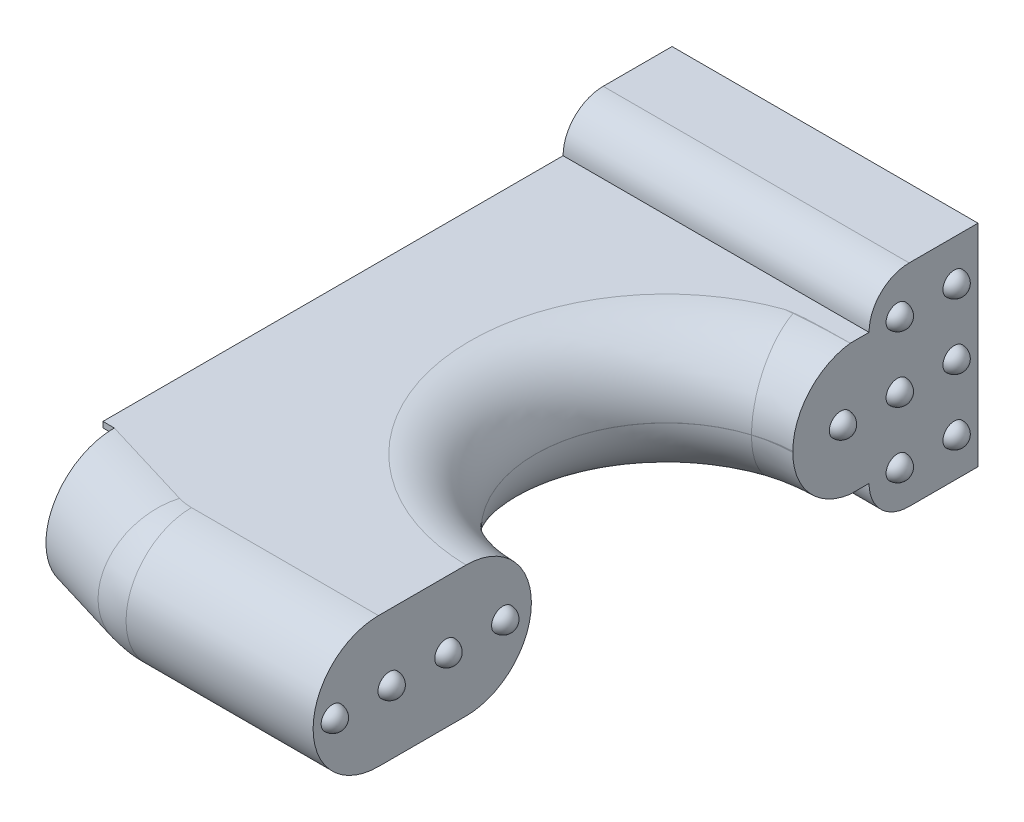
ISO-10303-21;
HEADER;
FILE_DESCRIPTION(('STEP AP214'),'2;1');
FILE_NAME('part.step','',(''),(''),'','','');
FILE_SCHEMA(('AUTOMOTIVE_DESIGN { 1 0 10303 214 1 1 1 1 }'));
ENDSEC;
DATA;
#1=APPLICATION_CONTEXT('core data for automotive mechanical design processes');
#2=APPLICATION_PROTOCOL_DEFINITION('international standard','automotive_design',2000,#1);
#3=PRODUCT_CONTEXT('',#1,'mechanical');
#4=PRODUCT('Part','Part','',(#3));
#5=PRODUCT_RELATED_PRODUCT_CATEGORY('part','',(#4));
#6=PRODUCT_DEFINITION_FORMATION('','',#4);
#7=PRODUCT_DEFINITION_CONTEXT('part definition',#1,'design');
#8=PRODUCT_DEFINITION('design','',#6,#7);
#9=PRODUCT_DEFINITION_SHAPE('','',#8);
#10=(LENGTH_UNIT() NAMED_UNIT(*) SI_UNIT(.MILLI.,.METRE.));
#11=(NAMED_UNIT(*) PLANE_ANGLE_UNIT() SI_UNIT($,.RADIAN.));
#12=(NAMED_UNIT(*) SI_UNIT($,.STERADIAN.) SOLID_ANGLE_UNIT());
#13=UNCERTAINTY_MEASURE_WITH_UNIT(LENGTH_MEASURE(1.E-05),#10,'distance_accuracy_value','');
#14=(GEOMETRIC_REPRESENTATION_CONTEXT(3) GLOBAL_UNCERTAINTY_ASSIGNED_CONTEXT((#13)) GLOBAL_UNIT_ASSIGNED_CONTEXT((#10,
#11,#12)) REPRESENTATION_CONTEXT('',''));
#15=CARTESIAN_POINT('',(0.,0.,0.));
#16=DIRECTION('',(0.,0.,1.));
#17=DIRECTION('',(1.,0.,0.));
#18=AXIS2_PLACEMENT_3D('',#15,#16,#17);
#19=CARTESIAN_POINT('',(8.61008406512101,-25.9939333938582,-2.05032495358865));
#20=DIRECTION('',(1.,0.,0.));
#21=DIRECTION('',(0.,0.,-1.));
#22=AXIS2_PLACEMENT_3D('',#19,#20,#21);
#23=PLANE('',#22);
#24=DIRECTION('',(0.,1.,2.77896811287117E-13));
#25=VECTOR('',#24,1.);
#26=CARTESIAN_POINT('',(8.61008406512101,-44.7715563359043,32.0675335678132));
#27=LINE('',#26,#25);
#28=CARTESIAN_POINT('',(8.61008406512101,-14.0315041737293,32.0675335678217));
#29=VERTEX_POINT('',#28);
#30=CARTESIAN_POINT('',(8.61008406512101,-14.0127541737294,32.0675335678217));
#31=VERTEX_POINT('',#30);
#32=EDGE_CURVE('E10',#29,#31,#27,.T.);
#33=ORIENTED_EDGE('',*,*,#32,.T.);
#34=CARTESIAN_POINT('',(8.61008406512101,-2.51275417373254,43.5711771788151));
#35=CARTESIAN_POINT('',(8.61008406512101,-2.51271941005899,43.2475716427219));
#36=CARTESIAN_POINT('',(8.61008406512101,-2.52640614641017,42.9239711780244));
#37=CARTESIAN_POINT('',(8.61008406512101,-2.58097051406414,42.2790857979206));
#38=CARTESIAN_POINT('',(8.61008406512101,-2.621846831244,41.9578007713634));
#39=CARTESIAN_POINT('',(8.61008406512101,-2.73049732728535,41.3200604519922));
#40=CARTESIAN_POINT('',(8.61008406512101,-2.7982512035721,41.0036017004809));
#41=CARTESIAN_POINT('',(8.61008406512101,-2.96016349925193,40.3775170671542));
#42=CARTESIAN_POINT('',(8.61008406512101,-3.05432159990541,40.0678911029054));
#43=CARTESIAN_POINT('',(8.61008406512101,-3.26842863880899,39.4575194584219));
#44=CARTESIAN_POINT('',(8.61008406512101,-3.38839007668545,39.1567781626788));
#45=CARTESIAN_POINT('',(8.61008406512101,-3.65322322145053,38.5664712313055));
#46=CARTESIAN_POINT('',(8.61008406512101,-3.79809493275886,38.2769055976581));
#47=CARTESIAN_POINT('',(8.61008406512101,-4.11169204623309,37.7110582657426));
#48=CARTESIAN_POINT('',(8.61008406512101,-4.2804133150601,37.4347742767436));
#49=CARTESIAN_POINT('',(8.61008406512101,-4.64052892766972,36.8974025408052));
#50=CARTESIAN_POINT('',(8.61008406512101,-4.83192314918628,36.6363147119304));
#51=CARTESIAN_POINT('',(8.61008406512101,-5.23602271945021,36.1311946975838));
#52=CARTESIAN_POINT('',(8.61008406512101,-5.44872772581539,35.8871622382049));
#53=CARTESIAN_POINT('',(8.61008406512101,-5.89394177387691,35.4178833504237));
#54=CARTESIAN_POINT('',(8.61008406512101,-6.12645092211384,35.1926370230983));
#55=CARTESIAN_POINT('',(8.61008406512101,-6.60966922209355,34.7624920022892));
#56=CARTESIAN_POINT('',(8.61008406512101,-6.86038201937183,34.5575974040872));
#57=CARTESIAN_POINT('',(8.61008406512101,-7.37817987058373,34.1696702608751));
#58=CARTESIAN_POINT('',(8.61008406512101,-7.64526466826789,33.9866373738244));
#59=CARTESIAN_POINT('',(8.61008406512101,-8.19390314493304,33.6437404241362));
#60=CARTESIAN_POINT('',(8.61008406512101,-8.47545634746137,33.4838755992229));
#61=CARTESIAN_POINT('',(8.61008406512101,-9.05103534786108,33.18844730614));
#62=CARTESIAN_POINT('',(8.61008406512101,-9.34506123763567,33.0528840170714));
#63=CARTESIAN_POINT('',(8.61008406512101,-9.94336426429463,32.807085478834));
#64=CARTESIAN_POINT('',(8.61008406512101,-10.24763644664,32.6968381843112));
#65=CARTESIAN_POINT('',(8.61008406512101,-10.8642694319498,32.5024037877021));
#66=CARTESIAN_POINT('',(8.61008406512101,-11.1766282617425,32.4182103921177));
#67=CARTESIAN_POINT('',(8.61008406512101,-11.9055803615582,32.25438901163));
#68=CARTESIAN_POINT('',(8.61008406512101,-12.3243840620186,32.1843208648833));
#69=CARTESIAN_POINT('',(8.61008406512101,-12.9559156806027,32.1142601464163));
#70=CARTESIAN_POINT('',(8.61008406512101,-13.1668586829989,32.0967468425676));
#71=CARTESIAN_POINT('',(8.61008406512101,-13.5894351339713,32.0733833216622));
#72=CARTESIAN_POINT('',(8.61008406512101,-13.8010687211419,32.0675356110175));
#73=CARTESIAN_POINT('',(8.61008406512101,-14.0127541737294,32.0675335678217));
#74=B_SPLINE_CURVE_WITH_KNOTS('',3,(#34,#35,#36,#37,#38,#39,#40,#41,#42,#43,#44,#45,#46,#47,#48,
#49,#50,#51,#52,#53,#54,#55,#56,#57,#58,#59,#60,#61,#62,#63,#64,#65,#66,#67,#68,#69,#70,#71,#72,
#73),.UNSPECIFIED.,.F.,.F.,(4,2,2,2,2,2,2,2,2,2,2,2,2,2,2,2,2,2,2,4),(0.,0.970520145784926,
1.94099338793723,2.91073495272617,3.88046481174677,4.85066548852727,5.82086633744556,
6.79089924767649,7.76092692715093,8.730939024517,9.7009563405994,10.6711684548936,
11.6413653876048,12.6115303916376,13.5817025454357,14.5514121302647,15.5208872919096,
16.7918134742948,17.4265492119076,18.0614213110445),.UNSPECIFIED.);
#75=CARTESIAN_POINT('',(8.61008406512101,-2.5127541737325,43.5711771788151));
#76=VERTEX_POINT('',#75);
#77=EDGE_CURVE('E35',#76,#31,#74,.T.);
#78=ORIENTED_EDGE('',*,*,#77,.F.);
#79=DIRECTION('',(0.,2.76834111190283E-13,-1.));
#80=VECTOR('',#79,1.);
#81=CARTESIAN_POINT('',(8.61008406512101,-2.51275417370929,-40.1772457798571));
#82=LINE('',#81,#80);
#83=CARTESIAN_POINT('',(8.61008406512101,-2.51275417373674,58.974179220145));
#84=VERTEX_POINT('',#83);
#85=EDGE_CURVE('E454',#84,#76,#82,.T.);
#86=ORIENTED_EDGE('',*,*,#85,.F.);
#87=CARTESIAN_POINT('',(8.61008406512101,-14.0221291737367,58.9741792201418));
#88=DIRECTION('',(1.,0.,0.));
#89=DIRECTION('',(0.,0.,-1.));
#90=AXIS2_PLACEMENT_3D('',#87,#88,#89);
#91=CIRCLE('',#90,11.509375);
#92=CARTESIAN_POINT('',(8.61008406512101,-25.5315041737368,58.9741792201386));
#93=VERTEX_POINT('',#92);
#94=EDGE_CURVE('E578',#93,#84,#91,.F.);
#95=ORIENTED_EDGE('',*,*,#94,.F.);
#96=DIRECTION('',(0.,-2.76834111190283E-13,1.));
#97=VECTOR('',#96,1.);
#98=CARTESIAN_POINT('',(8.61008406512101,-25.5315041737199,-2.05032495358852));
#99=LINE('',#98,#97);
#100=CARTESIAN_POINT('',(8.61008406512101,-25.5315041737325,43.5711771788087));
#101=VERTEX_POINT('',#100);
#102=EDGE_CURVE('E26',#93,#101,#99,.F.);
#103=ORIENTED_EDGE('',*,*,#102,.T.);
#104=CARTESIAN_POINT('',(8.61008406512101,-14.0315041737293,32.0675335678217));
#105=CARTESIAN_POINT('',(8.61008406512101,-14.3548570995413,32.0674986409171));
#106=CARTESIAN_POINT('',(8.61008406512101,-14.678204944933,32.0811764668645));
#107=CARTESIAN_POINT('',(8.61008406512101,-15.3225859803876,32.1357052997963));
#108=CARTESIAN_POINT('',(8.61008406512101,-15.6436192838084,32.1765549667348));
#109=CARTESIAN_POINT('',(8.61008406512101,-16.2808531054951,32.2851332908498));
#110=CARTESIAN_POINT('',(8.61008406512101,-16.5970571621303,32.3528411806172));
#111=CARTESIAN_POINT('',(8.61008406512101,-17.22263680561,32.5146414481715));
#112=CARTESIAN_POINT('',(8.61008406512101,-17.5320124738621,32.6087335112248));
#113=CARTESIAN_POINT('',(8.61008406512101,-18.1418884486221,32.82268606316));
#114=CARTESIAN_POINT('',(8.61008406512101,-18.4423844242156,32.9425588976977));
#115=CARTESIAN_POINT('',(8.61008406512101,-19.0322109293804,33.2071907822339));
#116=CARTESIAN_POINT('',(8.61008406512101,-19.3215414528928,33.3519498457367));
#117=CARTESIAN_POINT('',(8.61008406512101,-19.8869340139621,33.6652962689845));
#118=CARTESIAN_POINT('',(8.61008406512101,-20.1629982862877,33.8338795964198));
#119=CARTESIAN_POINT('',(8.61008406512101,-20.6999498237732,34.1936918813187));
#120=CARTESIAN_POINT('',(8.61008406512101,-20.9608371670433,34.3849207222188));
#121=CARTESIAN_POINT('',(8.61008406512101,-21.4656485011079,34.7887149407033));
#122=CARTESIAN_POINT('',(8.61008406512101,-21.7095682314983,35.0012856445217));
#123=CARTESIAN_POINT('',(8.61008406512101,-22.1786427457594,35.4462128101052));
#124=CARTESIAN_POINT('',(8.61008406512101,-22.4037974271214,35.6785693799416));
#125=CARTESIAN_POINT('',(8.61008406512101,-22.8337860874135,36.1614641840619));
#126=CARTESIAN_POINT('',(8.61008406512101,-23.0386159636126,36.4120060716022));
#127=CARTESIAN_POINT('',(8.61008406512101,-23.4264465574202,36.9294447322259));
#128=CARTESIAN_POINT('',(8.61008406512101,-23.6094476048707,37.1963412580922));
#129=CARTESIAN_POINT('',(8.61008406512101,-23.9524255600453,37.7447573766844));
#130=CARTESIAN_POINT('',(8.61008406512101,-24.1123889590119,38.0262854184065));
#131=CARTESIAN_POINT('',(8.61008406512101,-24.4080283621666,38.6018169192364));
#132=CARTESIAN_POINT('',(8.61008406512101,-24.543704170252,38.8958204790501));
#133=CARTESIAN_POINT('',(8.61008406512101,-24.7897458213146,39.4940848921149));
#134=CARTESIAN_POINT('',(8.61008406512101,-24.9001235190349,39.7983408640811));
#135=CARTESIAN_POINT('',(8.61008406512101,-25.0948383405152,40.414947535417));
#136=CARTESIAN_POINT('',(8.61008406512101,-25.1791817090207,40.7272962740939));
#137=CARTESIAN_POINT('',(8.61008406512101,-25.3436555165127,41.4574849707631));
#138=CARTESIAN_POINT('',(8.61008406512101,-25.4140956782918,41.877571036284));
#139=CARTESIAN_POINT('',(8.61008406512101,-25.4845287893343,42.5110524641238));
#140=CARTESIAN_POINT('',(8.61008406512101,-25.5021352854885,42.7226497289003));
#141=CARTESIAN_POINT('',(8.61008406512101,-25.5256231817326,43.1465395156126));
#142=CARTESIAN_POINT('',(8.61008406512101,-25.531502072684,43.3588321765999));
#143=CARTESIAN_POINT('',(8.61008406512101,-25.5315041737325,43.5711771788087));
#144=B_SPLINE_CURVE_WITH_KNOTS('',3,(#104,#105,#106,#107,#108,#109,#110,#111,#112,#113,#114,
#115,#116,#117,#118,#119,#120,#121,#122,#123,#124,#125,#126,#127,#128,#129,#130,#131,#132,#133,
#134,#135,#136,#137,#138,#139,#140,#141,#142,#143),.UNSPECIFIED.,.F.,.F.,(4,2,2,2,2,2,2,2,2,2,2,
2,2,2,2,2,2,2,2,4),(0.,0.969762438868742,1.93947705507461,2.90844332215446,3.87739803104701,
4.84681778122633,5.81623805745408,6.78549445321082,7.75474586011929,8.72423976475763,
9.69373896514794,10.6634334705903,11.6331133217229,12.6033594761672,13.5736134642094,
14.54341185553,15.5129774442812,16.7878586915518,17.4245716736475,18.0614208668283),.UNSPECIFIED.);
#145=EDGE_CURVE('E343',#29,#101,#144,.T.);
#146=ORIENTED_EDGE('',*,*,#145,.F.);
#147=EDGE_LOOP('',(#33,#78,#86,#95,#103,#146));
#148=FACE_BOUND('',#147,.T.);
#149=CARTESIAN_POINT('',(8.61008406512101,-14.0221291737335,47.0675335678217));
#150=DIRECTION('',(1.,0.,0.));
#151=DIRECTION('',(0.,0.,-1.));
#152=AXIS2_PLACEMENT_3D('',#149,#150,#151);
#153=CIRCLE('',#152,2.);
#154=CARTESIAN_POINT('',(8.61008406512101,-14.0221291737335,45.0675335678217));
#155=VERTEX_POINT('',#154);
#156=EDGE_CURVE('E246',#155,#155,#153,.T.);
#157=ORIENTED_EDGE('',*,*,#156,.F.);
#158=EDGE_LOOP('',(#157));
#159=FACE_BOUND('',#158,.T.);
#160=CARTESIAN_POINT('',(8.61008406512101,-14.022129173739,67.0675335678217));
#161=DIRECTION('',(1.,0.,0.));
#162=DIRECTION('',(0.,0.,-1.));
#163=AXIS2_PLACEMENT_3D('',#160,#161,#162);
#164=CIRCLE('',#163,2.);
#165=CARTESIAN_POINT('',(8.61008406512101,-14.022129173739,65.0675335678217));
#166=VERTEX_POINT('',#165);
#167=EDGE_CURVE('E231',#166,#166,#164,.T.);
#168=ORIENTED_EDGE('',*,*,#167,.F.);
#169=EDGE_LOOP('',(#168));
#170=FACE_BOUND('',#169,.T.);
#171=CARTESIAN_POINT('',(8.61008406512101,-14.0221291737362,57.0675335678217));
#172=DIRECTION('',(1.,0.,0.));
#173=DIRECTION('',(0.,0.,-1.));
#174=AXIS2_PLACEMENT_3D('',#171,#172,#173);
#175=CIRCLE('',#174,2.);
#176=CARTESIAN_POINT('',(8.61008406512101,-14.0221291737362,55.0675335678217));
#177=VERTEX_POINT('',#176);
#178=EDGE_CURVE('E243',#177,#177,#175,.T.);
#179=ORIENTED_EDGE('',*,*,#178,.F.);
#180=EDGE_LOOP('',(#179));
#181=FACE_BOUND('',#180,.T.);
#182=CARTESIAN_POINT('',(8.61008406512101,-14.0221291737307,37.0675335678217));
#183=DIRECTION('',(1.,0.,0.));
#184=DIRECTION('',(0.,0.,-1.));
#185=AXIS2_PLACEMENT_3D('',#182,#183,#184);
#186=CIRCLE('',#185,2.);
#187=CARTESIAN_POINT('',(8.61008406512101,-14.0221291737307,35.0675335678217));
#188=VERTEX_POINT('',#187);
#189=EDGE_CURVE('E234',#188,#188,#186,.T.);
#190=ORIENTED_EDGE('',*,*,#189,.F.);
#191=EDGE_LOOP('',(#190));
#192=FACE_BOUND('',#191,.T.);
#193=ADVANCED_FACE('F16',(#148,#159,#170,#181,#192),#23,.T.);
#194=CARTESIAN_POINT('',(8.61008406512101,-25.9939333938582,-2.05032495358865));
#195=DIRECTION('',(1.,0.,0.));
#196=DIRECTION('',(0.,0.,-1.));
#197=AXIS2_PLACEMENT_3D('',#194,#195,#196);
#198=PLANE('',#197);
#199=DIRECTION('',(0.,1.,2.77896811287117E-13));
#200=VECTOR('',#199,1.);
#201=CARTESIAN_POINT('',(8.61008406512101,-44.7715563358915,-13.9507907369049));
#202=LINE('',#201,#200);
#203=CARTESIAN_POINT('',(8.61008340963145,-13.9291855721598,-13.9508331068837));
#204=VERTEX_POINT('',#203);
#205=CARTESIAN_POINT('',(8.61008341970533,-14.1150737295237,-13.9508331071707));
#206=VERTEX_POINT('',#205);
#207=EDGE_CURVE('E1311',#204,#206,#202,.F.);
#208=ORIENTED_EDGE('',*,*,#207,.T.);
#209=CARTESIAN_POINT('',(8.61008406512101,-25.5411034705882,-24.1427421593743));
#210=CARTESIAN_POINT('',(8.61008406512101,-25.5042278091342,-23.8212486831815));
#211=CARTESIAN_POINT('',(8.61008406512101,-25.4537214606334,-23.5013252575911));
#212=CARTESIAN_POINT('',(8.61008406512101,-25.3259607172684,-22.866879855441));
#213=CARTESIAN_POINT('',(8.61008406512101,-25.2487076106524,-22.5523576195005));
#214=CARTESIAN_POINT('',(8.61008406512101,-25.0680252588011,-21.9311584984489));
#215=CARTESIAN_POINT('',(8.61008406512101,-24.9646140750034,-21.6244763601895));
#216=CARTESIAN_POINT('',(8.61008406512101,-24.7323366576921,-21.0209128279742));
#217=CARTESIAN_POINT('',(8.61008406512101,-24.6034707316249,-20.7240313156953));
#218=CARTESIAN_POINT('',(8.61008406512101,-24.3211257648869,-20.1420306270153));
#219=CARTESIAN_POINT('',(8.61008406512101,-24.1676345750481,-19.8569173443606));
#220=CARTESIAN_POINT('',(8.61008406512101,-23.8371766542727,-19.3006364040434));
#221=CARTESIAN_POINT('',(8.61008406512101,-23.6602099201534,-19.0294687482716));
#222=CARTESIAN_POINT('',(8.61008406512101,-23.2841067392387,-18.5030752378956));
#223=CARTESIAN_POINT('',(8.61008406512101,-23.0849759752,-18.2478453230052));
#224=CARTESIAN_POINT('',(8.61008406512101,-22.6659238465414,-17.7550682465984));
#225=CARTESIAN_POINT('',(8.61008406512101,-22.4460026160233,-17.5175209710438));
#226=CARTESIAN_POINT('',(8.61008406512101,-21.9869593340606,-17.0618256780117));
#227=CARTESIAN_POINT('',(8.61008406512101,-21.7478396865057,-16.8436752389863));
#228=CARTESIAN_POINT('',(8.61008406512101,-21.2520715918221,-16.4282905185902));
#229=CARTESIAN_POINT('',(8.61008406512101,-20.9954229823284,-16.2310564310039));
#230=CARTESIAN_POINT('',(8.61008406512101,-20.4662942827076,-15.858821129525));
#231=CARTESIAN_POINT('',(8.61008406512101,-20.1938066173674,-15.6838306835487));
#232=CARTESIAN_POINT('',(8.61008406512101,-19.6350587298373,-15.3574470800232));
#233=CARTESIAN_POINT('',(8.610084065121,-19.3487989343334,-15.2060531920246));
#234=CARTESIAN_POINT('',(8.610084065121,-18.7644448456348,-14.927893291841));
#235=CARTESIAN_POINT('',(8.61008406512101,-18.4663468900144,-14.8011349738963));
#236=CARTESIAN_POINT('',(8.61008406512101,-17.8605220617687,-14.5732116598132));
#237=CARTESIAN_POINT('',(8.61008406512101,-17.5527952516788,-14.4720464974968));
#238=CARTESIAN_POINT('',(8.61008406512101,-16.9303307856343,-14.2961507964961));
#239=CARTESIAN_POINT('',(8.61008406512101,-16.6156030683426,-14.2213850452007));
#240=CARTESIAN_POINT('',(8.61008406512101,-15.9810923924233,-14.0986615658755));
#241=CARTESIAN_POINT('',(8.61008406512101,-15.661311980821,-14.0506907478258));
#242=CARTESIAN_POINT('',(8.61008406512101,-15.1365550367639,-13.9944544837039));
#243=CARTESIAN_POINT('',(8.610084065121,-14.9324128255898,-13.9780822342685));
#244=CARTESIAN_POINT('',(8.61008406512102,-14.5238786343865,-13.9562767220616));
#245=CARTESIAN_POINT('',(8.61008406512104,-14.3194876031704,-13.950825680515));
#246=CARTESIAN_POINT('',(8.61008406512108,-14.1150737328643,-13.9508331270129));
#247=B_SPLINE_CURVE_WITH_KNOTS('',3,(#209,#210,#211,#212,#213,#214,#215,#216,#217,#218,#219,
#220,#221,#222,#223,#224,#225,#226,#227,#228,#229,#230,#231,#232,#233,#234,#235,#236,#237,#238,
#239,#240,#241,#242,#243,#244,#245,#246),.UNSPECIFIED.,.F.,.F.,(4,2,2,2,2,2,2,2,2,2,2,2,2,2,2,2,
2,2,4),(0.,0.970507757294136,1.94096877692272,2.9107615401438,3.88054259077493,4.85080357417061,
5.82106468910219,6.79107760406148,7.76108426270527,8.73096965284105,9.70086402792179,
10.6712261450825,11.6415582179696,12.6121928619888,13.58282120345,14.5521499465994,
15.5210047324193,16.1351284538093,16.7482516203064),.UNSPECIFIED.);
#248=CARTESIAN_POINT('',(8.61008406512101,-25.5293035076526,-24.043750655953));
#249=VERTEX_POINT('',#248);
#250=EDGE_CURVE('E647',#249,#206,#247,.T.);
#251=ORIENTED_EDGE('',*,*,#250,.F.);
#252=CARTESIAN_POINT('',(8.61008406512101,-25.5705783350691,-24.3159588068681));
#253=CARTESIAN_POINT('',(8.61008406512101,-25.5661694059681,-24.2914593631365));
#254=CARTESIAN_POINT('',(8.61008406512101,-25.5619434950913,-24.2669271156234));
#255=CARTESIAN_POINT('',(8.61008406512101,-25.5538585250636,-24.2178022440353));
#256=CARTESIAN_POINT('',(8.61008406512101,-25.5499994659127,-24.1932096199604));
#257=CARTESIAN_POINT('',(8.610084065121,-25.5401233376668,-24.127049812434));
#258=CARTESIAN_POINT('',(8.610084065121,-25.5344457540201,-24.0854317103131));
#259=CARTESIAN_POINT('',(8.61008406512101,-25.5292934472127,-24.0437476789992));
#260=B_SPLINE_CURVE_WITH_KNOTS('',3,(#252,#253,#254,#255,#256,#257,#258,#259),.UNSPECIFIED.,.F.,
.F.,(4,2,2,4),(0.,0.0746780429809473,0.149356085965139,0.275354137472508),.UNSPECIFIED.);
#261=CARTESIAN_POINT('',(8.61008406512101,-25.5315041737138,-24.0613756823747));
#262=VERTEX_POINT('',#261);
#263=EDGE_CURVE('E395',#249,#262,#260,.F.);
#264=ORIENTED_EDGE('',*,*,#263,.T.);
#265=DIRECTION('',(0.,-2.76834111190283E-13,1.));
#266=VECTOR('',#265,1.);
#267=CARTESIAN_POINT('',(8.61008406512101,-25.5315041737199,-2.05032495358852));
#268=LINE('',#267,#266);
#269=CARTESIAN_POINT('',(8.61008406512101,-25.5315041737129,-27.3629457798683));
#270=VERTEX_POINT('',#269);
#271=EDGE_CURVE('E397',#262,#270,#268,.F.);
#272=ORIENTED_EDGE('',*,*,#271,.T.);
#273=CARTESIAN_POINT('',(8.61008406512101,-25.5315041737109,-34.420175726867));
#274=DIRECTION('',(1.,0.,0.));
#275=DIRECTION('',(0.,0.,-1.));
#276=AXIS2_PLACEMENT_3D('',#273,#274,#275);
#277=CIRCLE('',#276,7.05722994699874);
#278=CARTESIAN_POINT('',(8.61008406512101,-32.5887341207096,-34.420175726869));
#279=VERTEX_POINT('',#278);
#280=EDGE_CURVE('E737',#279,#270,#277,.F.);
#281=ORIENTED_EDGE('',*,*,#280,.F.);
#282=DIRECTION('',(0.,-2.76834111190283E-13,1.));
#283=VECTOR('',#282,1.);
#284=CARTESIAN_POINT('',(8.61008406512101,-32.5887341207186,-2.05032495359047));
#285=LINE('',#284,#283);
#286=CARTESIAN_POINT('',(8.61008406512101,-32.5887341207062,-46.5399457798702));
#287=VERTEX_POINT('',#286);
#288=EDGE_CURVE('E400',#279,#287,#285,.F.);
#289=ORIENTED_EDGE('',*,*,#288,.T.);
#290=DIRECTION('',(0.,-1.,-2.76834111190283E-13));
#291=VECTOR('',#290,1.);
#292=CARTESIAN_POINT('',(8.61008406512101,-28.3096291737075,-46.539945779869));
#293=LINE('',#292,#291);
#294=CARTESIAN_POINT('',(8.61008406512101,4.54447577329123,-46.5399457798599));
#295=VERTEX_POINT('',#294);
#296=EDGE_CURVE('E1279',#295,#287,#293,.T.);
#297=ORIENTED_EDGE('',*,*,#296,.F.);
#298=DIRECTION('',(0.,2.76834111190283E-13,-1.));
#299=VECTOR('',#298,1.);
#300=CARTESIAN_POINT('',(8.61008406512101,4.54447577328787,-34.4201757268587));
#301=LINE('',#300,#299);
#302=CARTESIAN_POINT('',(8.61008406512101,4.54447577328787,-34.4201757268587));
#303=VERTEX_POINT('',#302);
#304=EDGE_CURVE('E529',#303,#295,#301,.T.);
#305=ORIENTED_EDGE('',*,*,#304,.F.);
#306=CARTESIAN_POINT('',(8.61008406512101,-2.51275417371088,-34.4201757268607));
#307=DIRECTION('',(1.,0.,0.));
#308=DIRECTION('',(0.,0.,-1.));
#309=AXIS2_PLACEMENT_3D('',#306,#307,#308);
#310=CIRCLE('',#309,7.05722994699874);
#311=CARTESIAN_POINT('',(8.61008406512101,-2.51275417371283,-27.3629457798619));
#312=VERTEX_POINT('',#311);
#313=EDGE_CURVE('E1284',#312,#303,#310,.F.);
#314=ORIENTED_EDGE('',*,*,#313,.F.);
#315=DIRECTION('',(0.,2.76834111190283E-13,-1.));
#316=VECTOR('',#315,1.);
#317=CARTESIAN_POINT('',(8.61008406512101,-2.51275417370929,-40.1772457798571));
#318=LINE('',#317,#316);
#319=CARTESIAN_POINT('',(8.61008406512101,-2.51275417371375,-24.061375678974));
#320=VERTEX_POINT('',#319);
#321=EDGE_CURVE('E453',#320,#312,#318,.T.);
#322=ORIENTED_EDGE('',*,*,#321,.F.);
#323=CARTESIAN_POINT('',(8.61008406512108,-2.51496489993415,-24.0437476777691));
#324=CARTESIAN_POINT('',(8.61008406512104,-2.51191124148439,-24.0684526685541));
#325=CARTESIAN_POINT('',(8.61008406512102,-2.50867306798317,-24.0931347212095));
#326=CARTESIAN_POINT('',(8.610084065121,-2.50182846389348,-24.1424477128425));
#327=CARTESIAN_POINT('',(8.610084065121,-2.49822203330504,-24.1670786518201));
#328=CARTESIAN_POINT('',(8.61008406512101,-2.48803701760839,-24.2331916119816));
#329=CARTESIAN_POINT('',(8.61008406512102,-2.48111911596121,-24.274621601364));
#330=CARTESIAN_POINT('',(8.61008406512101,-2.47368001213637,-24.3159588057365));
#331=B_SPLINE_CURVE_WITH_KNOTS('',3,(#323,#324,#325,#326,#327,#328,#329,#330),.UNSPECIFIED.,.F.,
.F.,(4,2,2,4),(0.,0.0746780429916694,0.149356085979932,0.275354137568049),.UNSPECIFIED.);
#332=CARTESIAN_POINT('',(8.61008401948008,-2.51495442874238,-24.0437539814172));
#333=VERTEX_POINT('',#332);
#334=EDGE_CURVE('E403',#320,#333,#331,.F.);
#335=ORIENTED_EDGE('',*,*,#334,.T.);
#336=CARTESIAN_POINT('',(8.61008406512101,-13.929185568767,-13.9508331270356));
#337=CARTESIAN_POINT('',(8.61008406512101,-13.6058267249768,-13.9507905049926));
#338=CARTESIAN_POINT('',(8.61008406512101,-13.282472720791,-13.9644611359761));
#339=CARTESIAN_POINT('',(8.61008406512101,-12.6380788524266,-14.0189758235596));
#340=CARTESIAN_POINT('',(8.61008406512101,-12.3170388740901,-14.0598185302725));
#341=CARTESIAN_POINT('',(8.61008406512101,-11.6797708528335,-14.1683858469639));
#342=CARTESIAN_POINT('',(8.61008406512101,-11.3635395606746,-14.2360913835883));
#343=CARTESIAN_POINT('',(8.61008406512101,-10.7379052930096,-14.3978891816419));
#344=CARTESIAN_POINT('',(8.61008406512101,-10.4285022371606,-14.4919811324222));
#345=CARTESIAN_POINT('',(8.61008406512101,-9.8185693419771,-14.7059359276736));
#346=CARTESIAN_POINT('',(8.61008406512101,-9.51804389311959,-14.8258112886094));
#347=CARTESIAN_POINT('',(8.61008406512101,-8.92815843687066,-15.0904500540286));
#348=CARTESIAN_POINT('',(8.61008406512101,-8.63879843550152,-15.2352134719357));
#349=CARTESIAN_POINT('',(8.61008406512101,-8.07336997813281,-15.5485575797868));
#350=CARTESIAN_POINT('',(8.61008406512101,-7.79729821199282,-15.7171322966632));
#351=CARTESIAN_POINT('',(8.61008406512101,-7.26032945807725,-16.0769254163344));
#352=CARTESIAN_POINT('',(8.61008406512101,-6.99943237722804,-16.2681436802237));
#353=CARTESIAN_POINT('',(8.61008406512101,-6.49460635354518,-16.6719094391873));
#354=CARTESIAN_POINT('',(8.61008406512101,-6.25068116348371,-16.884461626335));
#355=CARTESIAN_POINT('',(8.61008406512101,-5.78159087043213,-17.3293508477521));
#356=CARTESIAN_POINT('',(8.61008406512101,-5.55642594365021,-17.5616880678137));
#357=CARTESIAN_POINT('',(8.61008406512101,-5.12635263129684,-18.0446110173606));
#358=CARTESIAN_POINT('',(8.61008406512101,-4.92145406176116,-18.2952054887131));
#359=CARTESIAN_POINT('',(8.61008406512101,-4.53349804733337,-18.8127542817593));
#360=CARTESIAN_POINT('',(8.61008406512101,-4.35043993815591,-19.0797081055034));
#361=CARTESIAN_POINT('',(8.61008406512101,-4.00729872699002,-19.628338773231));
#362=CARTESIAN_POINT('',(8.61008406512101,-3.84723708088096,-19.9100290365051));
#363=CARTESIAN_POINT('',(8.61008406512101,-3.55143044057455,-20.4859005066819));
#364=CARTESIAN_POINT('',(8.61008406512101,-3.4156853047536,-20.7800816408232));
#365=CARTESIAN_POINT('',(8.61008406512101,-3.16964255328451,-21.3784332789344));
#366=CARTESIAN_POINT('',(8.61008406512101,-3.05931132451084,-21.6825899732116));
#367=CARTESIAN_POINT('',(8.61008406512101,-2.86468960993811,-22.2989919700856));
#368=CARTESIAN_POINT('',(8.61008406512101,-2.7803864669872,-22.6112332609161));
#369=CARTESIAN_POINT('',(8.61008406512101,-2.66412628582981,-23.1272743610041));
#370=CARTESIAN_POINT('',(8.61008406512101,-2.62427352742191,-23.3293298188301));
#371=CARTESIAN_POINT('',(8.61008406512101,-2.55551856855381,-23.734955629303));
#372=CARTESIAN_POINT('',(8.61008406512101,-2.52659858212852,-23.9385229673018));
#373=CARTESIAN_POINT('',(8.61008406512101,-2.50315487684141,-24.1427421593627));
#374=B_SPLINE_CURVE_WITH_KNOTS('',3,(#336,#337,#338,#339,#340,#341,#342,#343,#344,#345,#346,
#347,#348,#349,#350,#351,#352,#353,#354,#355,#356,#357,#358,#359,#360,#361,#362,#363,#364,#365,
#366,#367,#368,#369,#370,#371,#372,#373),.UNSPECIFIED.,.F.,.F.,(4,2,2,2,2,2,2,2,2,2,2,2,2,2,2,2,
2,2,4),(0.,0.969780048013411,1.93951192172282,2.90855648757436,3.87758964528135,
4.84709428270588,5.81659944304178,6.78586183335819,7.75511827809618,8.72458836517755,
9.69406755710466,10.6640140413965,11.6339310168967,12.6047471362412,13.5755576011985,
14.5450765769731,15.5141233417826,16.1316941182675,16.7482558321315),.UNSPECIFIED.);
#375=EDGE_CURVE('E648',#204,#333,#374,.T.);
#376=ORIENTED_EDGE('',*,*,#375,.F.);
#377=EDGE_LOOP('',(#208,#251,#264,#272,#281,#289,#297,#305,#314,#322,#335,#376));
#378=FACE_BOUND('',#377,.T.);
#379=CARTESIAN_POINT('',(8.61008406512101,-2.51275417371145,-32.3629457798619));
#380=DIRECTION('',(1.,0.,0.));
#381=DIRECTION('',(0.,0.,-1.));
#382=AXIS2_PLACEMENT_3D('',#379,#380,#381);
#383=CIRCLE('',#382,2.);
#384=CARTESIAN_POINT('',(8.61008406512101,-2.51275417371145,-34.3629457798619));
#385=VERTEX_POINT('',#384);
#386=EDGE_CURVE('E240',#385,#385,#383,.T.);
#387=ORIENTED_EDGE('',*,*,#386,.F.);
#388=EDGE_LOOP('',(#387));
#389=FACE_BOUND('',#388,.T.);
#390=CARTESIAN_POINT('',(8.61008406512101,-25.5315041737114,-32.3629457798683));
#391=DIRECTION('',(1.,0.,0.));
#392=DIRECTION('',(0.,0.,-1.));
#393=AXIS2_PLACEMENT_3D('',#390,#391,#392);
#394=CIRCLE('',#393,2.);
#395=CARTESIAN_POINT('',(8.61008406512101,-25.5315041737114,-34.3629457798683));
#396=VERTEX_POINT('',#395);
#397=EDGE_CURVE('E249',#396,#396,#394,.T.);
#398=ORIENTED_EDGE('',*,*,#397,.F.);
#399=EDGE_LOOP('',(#398));
#400=FACE_BOUND('',#399,.T.);
#401=CARTESIAN_POINT('',(8.61008406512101,-2.51275417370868,-42.3629457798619));
#402=DIRECTION('',(1.,0.,0.));
#403=DIRECTION('',(0.,0.,-1.));
#404=AXIS2_PLACEMENT_3D('',#401,#402,#403);
#405=CIRCLE('',#404,2.);
#406=CARTESIAN_POINT('',(8.61008406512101,-2.51275417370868,-44.3629457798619));
#407=VERTEX_POINT('',#406);
#408=EDGE_CURVE('E261',#407,#407,#405,.T.);
#409=ORIENTED_EDGE('',*,*,#408,.F.);
#410=EDGE_LOOP('',(#409));
#411=FACE_BOUND('',#410,.T.);
#412=CARTESIAN_POINT('',(8.61008406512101,-25.5315041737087,-42.3629457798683));
#413=DIRECTION('',(1.,0.,0.));
#414=DIRECTION('',(0.,0.,-1.));
#415=AXIS2_PLACEMENT_3D('',#412,#413,#414);
#416=CIRCLE('',#415,2.);
#417=CARTESIAN_POINT('',(8.61008406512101,-25.5315041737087,-44.3629457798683));
#418=VERTEX_POINT('',#417);
#419=EDGE_CURVE('E237',#418,#418,#416,.T.);
#420=ORIENTED_EDGE('',*,*,#419,.F.);
#421=EDGE_LOOP('',(#420));
#422=FACE_BOUND('',#421,.T.);
#423=CARTESIAN_POINT('',(8.61008406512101,-14.0221291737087,-42.3629457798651));
#424=DIRECTION('',(1.,0.,0.));
#425=DIRECTION('',(0.,0.,-1.));
#426=AXIS2_PLACEMENT_3D('',#423,#424,#425);
#427=CIRCLE('',#426,2.);
#428=CARTESIAN_POINT('',(8.61008406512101,-14.0221291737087,-44.3629457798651));
#429=VERTEX_POINT('',#428);
#430=EDGE_CURVE('E258',#429,#429,#427,.T.);
#431=ORIENTED_EDGE('',*,*,#430,.F.);
#432=EDGE_LOOP('',(#431));
#433=FACE_BOUND('',#432,.T.);
#434=CARTESIAN_POINT('',(8.61008406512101,-14.0221291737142,-22.3629457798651));
#435=DIRECTION('',(1.,0.,0.));
#436=DIRECTION('',(0.,0.,-1.));
#437=AXIS2_PLACEMENT_3D('',#434,#435,#436);
#438=CIRCLE('',#437,2.);
#439=CARTESIAN_POINT('',(8.61008406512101,-14.0221291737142,-24.3629457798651));
#440=VERTEX_POINT('',#439);
#441=EDGE_CURVE('E252',#440,#440,#438,.T.);
#442=ORIENTED_EDGE('',*,*,#441,.F.);
#443=EDGE_LOOP('',(#442));
#444=FACE_BOUND('',#443,.T.);
#445=CARTESIAN_POINT('',(8.61008406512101,-14.0221291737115,-32.3629457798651));
#446=DIRECTION('',(1.,0.,0.));
#447=DIRECTION('',(0.,0.,-1.));
#448=AXIS2_PLACEMENT_3D('',#445,#446,#447);
#449=CIRCLE('',#448,2.);
#450=CARTESIAN_POINT('',(8.61008406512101,-14.0221291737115,-34.3629457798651));
#451=VERTEX_POINT('',#450);
#452=EDGE_CURVE('E255',#451,#451,#449,.T.);
#453=ORIENTED_EDGE('',*,*,#452,.F.);
#454=EDGE_LOOP('',(#453));
#455=FACE_BOUND('',#454,.T.);
#456=ADVANCED_FACE('F321',(#378,#389,#400,#411,#422,#433,#444,#455),#198,.T.);
#457=CARTESIAN_POINT('',(-43.2867303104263,-14.0221291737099,-37.9258207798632));
#458=DIRECTION('',(0.,0.,1.));
#459=DIRECTION('',(1.,0.,0.));
#460=AXIS2_PLACEMENT_3D('',#457,#458,#459);
#461=SPHERICAL_SURFACE('',#460,6.35);
#462=CARTESIAN_POINT('',(-43.2867303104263,-14.0221291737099,-37.9258207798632));
#463=DIRECTION('',(0.,-2.76834111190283E-13,1.));
#464=DIRECTION('',(1.,0.,0.));
#465=AXIS2_PLACEMENT_3D('',#462,#463,#464);
#466=CIRCLE('',#465,6.35);
#467=CARTESIAN_POINT('',(-43.2377303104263,-20.3719401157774,-37.9258207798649));
#468=VERTEX_POINT('',#467);
#469=CARTESIAN_POINT('',(-43.2377303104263,-7.67231823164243,-37.9258207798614));
#470=VERTEX_POINT('',#469);
#471=EDGE_CURVE('E406',#468,#470,#466,.T.);
#472=ORIENTED_EDGE('',*,*,#471,.T.);
#473=CARTESIAN_POINT('',(-43.2377303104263,-14.0221291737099,-37.9258207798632));
#474=DIRECTION('',(1.,0.,0.));
#475=DIRECTION('',(0.,0.,-1.));
#476=AXIS2_PLACEMENT_3D('',#473,#474,#475);
#477=CIRCLE('',#476,6.34981094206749);
#478=EDGE_CURVE('E414',#470,#468,#477,.F.);
#479=ORIENTED_EDGE('',*,*,#478,.T.);
#480=EDGE_LOOP('',(#472,#479));
#481=FACE_BOUND('',#480,.T.);
#482=ADVANCED_FACE('F327',(#481),#461,.F.);
#483=CARTESIAN_POINT('',(-43.2867303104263,-14.0221291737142,-22.4994411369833));
#484=DIRECTION('',(0.,2.76879641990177E-13,-1.));
#485=DIRECTION('',(-1.,0.,0.));
#486=AXIS2_PLACEMENT_3D('',#483,#484,#485);
#487=CYLINDRICAL_SURFACE('',#486,6.35);
#488=ORIENTED_EDGE('',*,*,#471,.F.);
#489=DIRECTION('',(0.,2.76879641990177E-13,-1.));
#490=VECTOR('',#489,1.);
#491=CARTESIAN_POINT('',(-43.2377303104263,-20.3719401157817,-22.4994411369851));
#492=LINE('',#491,#490);
#493=CARTESIAN_POINT('',(-43.2377303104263,-20.3719401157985,38.2741792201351));
#494=VERTEX_POINT('',#493);
#495=EDGE_CURVE('E499',#468,#494,#492,.F.);
#496=ORIENTED_EDGE('',*,*,#495,.T.);
#497=CARTESIAN_POINT('',(-43.2867303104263,-14.022129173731,38.2741792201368));
#498=DIRECTION('',(0.,-2.76834111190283E-13,1.));
#499=DIRECTION('',(1.,0.,0.));
#500=AXIS2_PLACEMENT_3D('',#497,#498,#499);
#501=CIRCLE('',#500,6.35);
#502=CARTESIAN_POINT('',(-43.2377303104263,-7.67231823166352,38.2741792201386));
#503=VERTEX_POINT('',#502);
#504=EDGE_CURVE('E493',#494,#503,#501,.T.);
#505=ORIENTED_EDGE('',*,*,#504,.T.);
#506=DIRECTION('',(0.,2.76879641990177E-13,-1.));
#507=VECTOR('',#506,1.);
#508=CARTESIAN_POINT('',(-43.2377303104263,-7.6723182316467,-22.4994411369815));
#509=LINE('',#508,#507);
#510=EDGE_CURVE('E492',#503,#470,#509,.T.);
#511=ORIENTED_EDGE('',*,*,#510,.T.);
#512=EDGE_LOOP('',(#488,#496,#505,#511));
#513=FACE_BOUND('',#512,.T.);
#514=ADVANCED_FACE('F476',(#513),#487,.F.);
#515=CARTESIAN_POINT('',(-43.2867303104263,-14.022129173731,38.2741792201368));
#516=DIRECTION('',(0.,0.,1.));
#517=DIRECTION('',(1.,0.,0.));
#518=AXIS2_PLACEMENT_3D('',#515,#516,#517);
#519=SPHERICAL_SURFACE('',#518,6.35);
#520=ORIENTED_EDGE('',*,*,#504,.F.);
#521=CARTESIAN_POINT('',(-43.2377303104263,-14.022129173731,38.2741792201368));
#522=DIRECTION('',(1.,0.,0.));
#523=DIRECTION('',(0.,0.,-1.));
#524=AXIS2_PLACEMENT_3D('',#521,#522,#523);
#525=CIRCLE('',#524,6.34981094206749);
#526=EDGE_CURVE('E497',#494,#503,#525,.F.);
#527=ORIENTED_EDGE('',*,*,#526,.T.);
#528=EDGE_LOOP('',(#520,#527));
#529=FACE_BOUND('',#528,.T.);
#530=ADVANCED_FACE('F473',(#529),#519,.F.);
#531=CARTESIAN_POINT('',(-43.2377303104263,303.176234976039,-127.100454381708));
#532=DIRECTION('',(1.,0.,0.));
#533=DIRECTION('',(0.,0.,-1.));
#534=AXIS2_PLACEMENT_3D('',#531,#532,#533);
#535=PLANE('',#534);
#536=DIRECTION('',(0.,-2.76834111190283E-13,1.));
#537=VECTOR('',#536,1.);
#538=CARTESIAN_POINT('',(-43.2377303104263,-24.5315041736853,-127.100454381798));
#539=LINE('',#538,#537);
#540=CARTESIAN_POINT('',(-43.2377303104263,-24.5315041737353,53.627944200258));
#541=VERTEX_POINT('',#540);
#542=CARTESIAN_POINT('',(-43.2377303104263,-24.5315041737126,-28.4460620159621));
#543=VERTEX_POINT('',#542);
#544=EDGE_CURVE('E1240',#541,#543,#539,.F.);
#545=ORIENTED_EDGE('',*,*,#544,.F.);
#546=DIRECTION('',(0.,-1.,-2.76834111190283E-13));
#547=VECTOR('',#546,1.);
#548=CARTESIAN_POINT('',(-43.2377303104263,303.176234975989,53.6279442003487));
#549=LINE('',#548,#547);
#550=CARTESIAN_POINT('',(-43.2377303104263,-25.5315041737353,53.6279442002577));
#551=VERTEX_POINT('',#550);
#552=EDGE_CURVE('E501',#541,#551,#549,.T.);
#553=ORIENTED_EDGE('',*,*,#552,.T.);
#554=CARTESIAN_POINT('',(-43.2377303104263,-14.0221291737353,53.6279442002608));
#555=DIRECTION('',(1.,0.,0.));
#556=DIRECTION('',(0.,-2.76834111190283E-13,1.));
#557=AXIS2_PLACEMENT_3D('',#554,#555,#556);
#558=ELLIPSE('',#557,12.0246439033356,11.509375);
#559=CARTESIAN_POINT('',(-43.2377303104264,-2.51275417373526,53.627944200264));
#560=VERTEX_POINT('',#559);
#561=EDGE_CURVE('E506',#551,#560,#558,.F.);
#562=ORIENTED_EDGE('',*,*,#561,.T.);
#563=DIRECTION('',(0.,-1.,-2.76834111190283E-13));
#564=VECTOR('',#563,1.);
#565=CARTESIAN_POINT('',(-43.2377303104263,303.176234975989,53.6279442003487));
#566=LINE('',#565,#564);
#567=CARTESIAN_POINT('',(-43.2377303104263,-3.51275417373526,53.6279442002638));
#568=VERTEX_POINT('',#567);
#569=EDGE_CURVE('E509',#560,#568,#566,.T.);
#570=ORIENTED_EDGE('',*,*,#569,.T.);
#571=DIRECTION('',(0.,2.76834111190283E-13,-1.));
#572=VECTOR('',#571,1.);
#573=CARTESIAN_POINT('',(-43.2377303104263,-3.51275417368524,-127.100454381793));
#574=LINE('',#573,#572);
#575=CARTESIAN_POINT('',(-43.2377303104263,-3.51275417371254,-28.4460620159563));
#576=VERTEX_POINT('',#575);
#577=EDGE_CURVE('E512',#568,#576,#574,.T.);
#578=ORIENTED_EDGE('',*,*,#577,.T.);
#579=CARTESIAN_POINT('',(-43.2377303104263,-2.51275417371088,-34.4201757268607));
#580=DIRECTION('',(1.,0.,0.));
#581=DIRECTION('',(0.,0.,-1.));
#582=AXIS2_PLACEMENT_3D('',#579,#580,#581);
#583=CIRCLE('',#582,6.05722994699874);
#584=CARTESIAN_POINT('',(-43.2377303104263,3.54447577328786,-34.420175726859));
#585=VERTEX_POINT('',#584);
#586=EDGE_CURVE('E515',#576,#585,#583,.F.);
#587=ORIENTED_EDGE('',*,*,#586,.T.);
#588=DIRECTION('',(0.,2.76834111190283E-13,-1.));
#589=VECTOR('',#588,1.);
#590=CARTESIAN_POINT('',(-43.2377303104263,3.54447577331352,-127.100454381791));
#591=LINE('',#590,#589);
#592=CARTESIAN_POINT('',(-43.2377303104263,3.54447577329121,-46.5399457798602));
#593=VERTEX_POINT('',#592);
#594=EDGE_CURVE('E518',#585,#593,#591,.T.);
#595=ORIENTED_EDGE('',*,*,#594,.T.);
#596=DIRECTION('',(0.,1.,2.76834111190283E-13));
#597=VECTOR('',#596,1.);
#598=CARTESIAN_POINT('',(-43.2377303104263,303.176234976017,-46.5399457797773));
#599=LINE('',#598,#597);
#600=CARTESIAN_POINT('',(-43.2377303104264,-31.5887341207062,-46.5399457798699));
#601=VERTEX_POINT('',#600);
#602=EDGE_CURVE('E521',#593,#601,#599,.F.);
#603=ORIENTED_EDGE('',*,*,#602,.T.);
#604=DIRECTION('',(0.,-2.76834111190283E-13,1.));
#605=VECTOR('',#604,1.);
#606=CARTESIAN_POINT('',(-43.2377303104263,-31.5887341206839,-127.1004543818));
#607=LINE('',#606,#605);
#608=CARTESIAN_POINT('',(-43.2377303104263,-31.5887341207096,-34.4201757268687));
#609=VERTEX_POINT('',#608);
#610=EDGE_CURVE('E209',#609,#601,#607,.F.);
#611=ORIENTED_EDGE('',*,*,#610,.F.);
#612=CARTESIAN_POINT('',(-43.2377303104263,-25.5315041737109,-34.420175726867));
#613=DIRECTION('',(1.,0.,0.));
#614=DIRECTION('',(0.,0.,-1.));
#615=AXIS2_PLACEMENT_3D('',#612,#613,#614);
#616=CIRCLE('',#615,6.05722994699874);
#617=EDGE_CURVE('E206',#609,#543,#616,.F.);
#618=ORIENTED_EDGE('',*,*,#617,.T.);
#619=EDGE_LOOP('',(#545,#553,#562,#570,#578,#587,#595,#603,#611,#618));
#620=FACE_BOUND('',#619,.T.);
#621=ORIENTED_EDGE('',*,*,#526,.F.);
#622=ORIENTED_EDGE('',*,*,#495,.F.);
#623=ORIENTED_EDGE('',*,*,#478,.F.);
#624=ORIENTED_EDGE('',*,*,#510,.F.);
#625=EDGE_LOOP('',(#621,#622,#623,#624));
#626=FACE_BOUND('',#625,.T.);
#627=ADVANCED_FACE('F469',(#620,#626),#535,.F.);
#628=CARTESIAN_POINT('',(202.008746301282,-32.5887341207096,-34.420175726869));
#629=DIRECTION('',(0.,1.,2.76834111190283E-13));
#630=DIRECTION('',(0.,-2.76834111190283E-13,1.));
#631=AXIS2_PLACEMENT_3D('',#628,#629,#630);
#632=PLANE('',#631);
#633=DIRECTION('',(1.,0.,0.));
#634=VECTOR('',#633,1.);
#635=CARTESIAN_POINT('',(-45.2377303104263,-32.5887341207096,-34.420175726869));
#636=LINE('',#635,#634);
#637=CARTESIAN_POINT('',(-45.2377303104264,-32.5887341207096,-34.420175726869));
#638=VERTEX_POINT('',#637);
#639=EDGE_CURVE('E736',#638,#279,#636,.T.);
#640=ORIENTED_EDGE('',*,*,#639,.F.);
#641=DIRECTION('',(0.,2.76834111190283E-13,-1.));
#642=VECTOR('',#641,1.);
#643=CARTESIAN_POINT('',(-45.2377303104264,-32.5887341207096,-34.420175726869));
#644=LINE('',#643,#642);
#645=CARTESIAN_POINT('',(-45.2377303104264,-32.5887341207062,-46.5399457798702));
#646=VERTEX_POINT('',#645);
#647=EDGE_CURVE('E525',#638,#646,#644,.T.);
#648=ORIENTED_EDGE('',*,*,#647,.T.);
#649=DIRECTION('',(1.,0.,0.));
#650=VECTOR('',#649,1.);
#651=CARTESIAN_POINT('',(223.513069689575,-32.5887341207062,-46.5399457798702));
#652=LINE('',#651,#650);
#653=EDGE_CURVE('E1277',#287,#646,#652,.F.);
#654=ORIENTED_EDGE('',*,*,#653,.F.);
#655=ORIENTED_EDGE('',*,*,#288,.F.);
#656=EDGE_LOOP('',(#640,#648,#654,#655));
#657=FACE_BOUND('',#656,.T.);
#658=ADVANCED_FACE('F465',(#657),#632,.F.);
#659=CARTESIAN_POINT('',(202.008746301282,4.54447577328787,-34.4201757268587));
#660=DIRECTION('',(0.,1.,2.76834111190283E-13));
#661=DIRECTION('',(0.,-2.76834111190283E-13,1.));
#662=AXIS2_PLACEMENT_3D('',#659,#660,#661);
#663=PLANE('',#662);
#664=DIRECTION('',(1.,0.,0.));
#665=VECTOR('',#664,1.);
#666=CARTESIAN_POINT('',(223.513069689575,4.54447577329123,-46.53994577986));
#667=LINE('',#666,#665);
#668=CARTESIAN_POINT('',(-45.2377303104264,4.54447577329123,-46.5399457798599));
#669=VERTEX_POINT('',#668);
#670=EDGE_CURVE('E579',#669,#295,#667,.T.);
#671=ORIENTED_EDGE('',*,*,#670,.F.);
#672=DIRECTION('',(0.,-2.76834111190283E-13,1.));
#673=VECTOR('',#672,1.);
#674=CARTESIAN_POINT('',(-45.2377303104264,4.54447577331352,-127.10045438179));
#675=LINE('',#674,#673);
#676=CARTESIAN_POINT('',(-45.2377303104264,4.54447577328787,-34.4201757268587));
#677=VERTEX_POINT('',#676);
#678=EDGE_CURVE('E1251',#677,#669,#675,.F.);
#679=ORIENTED_EDGE('',*,*,#678,.F.);
#680=DIRECTION('',(1.,0.,0.));
#681=VECTOR('',#680,1.);
#682=CARTESIAN_POINT('',(-45.2377303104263,4.54447577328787,-34.4201757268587));
#683=LINE('',#682,#681);
#684=EDGE_CURVE('E528',#677,#303,#683,.T.);
#685=ORIENTED_EDGE('',*,*,#684,.T.);
#686=ORIENTED_EDGE('',*,*,#304,.T.);
#687=EDGE_LOOP('',(#671,#679,#685,#686));
#688=FACE_BOUND('',#687,.T.);
#689=ADVANCED_FACE('F461',(#688),#663,.T.);
#690=CARTESIAN_POINT('',(228.512180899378,-2.51275417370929,-40.1772457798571));
#691=DIRECTION('',(0.,1.,2.76834111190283E-13));
#692=DIRECTION('',(0.,-2.76834111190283E-13,1.));
#693=AXIS2_PLACEMENT_3D('',#690,#691,#692);
#694=PLANE('',#693);
#695=DIRECTION('',(-1.,0.,0.));
#696=VECTOR('',#695,1.);
#697=CARTESIAN_POINT('',(202.008746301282,-2.51275417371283,-27.3629457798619));
#698=LINE('',#697,#696);
#699=CARTESIAN_POINT('',(-45.2377303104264,-2.51275417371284,-27.3629457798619));
#700=VERTEX_POINT('',#699);
#701=EDGE_CURVE('E739',#700,#312,#698,.F.);
#702=ORIENTED_EDGE('',*,*,#701,.F.);
#703=DIRECTION('',(0.,-2.76834111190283E-13,1.));
#704=VECTOR('',#703,1.);
#705=CARTESIAN_POINT('',(-45.2377303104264,-2.51275417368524,-127.100454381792));
#706=LINE('',#705,#704);
#707=CARTESIAN_POINT('',(-45.2377303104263,-2.51275417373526,53.627944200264));
#708=VERTEX_POINT('',#707);
#709=EDGE_CURVE('E1256',#708,#700,#706,.F.);
#710=ORIENTED_EDGE('',*,*,#709,.F.);
#711=DIRECTION('',(1.,0.,0.));
#712=VECTOR('',#711,1.);
#713=CARTESIAN_POINT('',(228.512180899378,-2.51275417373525,53.627944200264));
#714=LINE('',#713,#712);
#715=EDGE_CURVE('E531',#708,#560,#714,.T.);
#716=ORIENTED_EDGE('',*,*,#715,.T.);
#717=DIRECTION('',(0.957148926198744,0.,0.289596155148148));
#718=VECTOR('',#717,1.);
#719=CARTESIAN_POINT('',(-43.2377303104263,-2.51275417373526,53.627944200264));
#720=LINE('',#719,#718);
#721=CARTESIAN_POINT('',(-26.770310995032,-2.51275417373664,58.6103468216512));
#722=VERTEX_POINT('',#721);
#723=EDGE_CURVE('E532',#560,#722,#720,.T.);
#724=ORIENTED_EDGE('',*,*,#723,.T.);
#725=CARTESIAN_POINT('',(-24.3114586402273,-2.51275417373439,50.483554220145));
#726=DIRECTION('',(0.,1.,2.76834111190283E-13));
#727=DIRECTION('',(1.,0.,0.));
#728=AXIS2_PLACEMENT_3D('',#725,#726,#727);
#729=CIRCLE('',#728,8.490625);
#730=CARTESIAN_POINT('',(-24.3114586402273,-2.51275417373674,58.974179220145));
#731=VERTEX_POINT('',#730);
#732=EDGE_CURVE('E536',#722,#731,#729,.T.);
#733=ORIENTED_EDGE('',*,*,#732,.T.);
#734=DIRECTION('',(1.,0.,0.));
#735=VECTOR('',#734,1.);
#736=CARTESIAN_POINT('',(-24.3114586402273,-2.51275417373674,58.974179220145));
#737=LINE('',#736,#735);
#738=EDGE_CURVE('E541',#731,#84,#737,.T.);
#739=ORIENTED_EDGE('',*,*,#738,.T.);
#740=ORIENTED_EDGE('',*,*,#85,.T.);
#741=CARTESIAN_POINT('',(9.31951928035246,-2.51275417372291,9.05837141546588));
#742=DIRECTION('',(0.,-1.,-2.76834111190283E-13));
#743=DIRECTION('',(0.,2.76834111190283E-13,-1.));
#744=AXIS2_PLACEMENT_3D('',#741,#742,#743);
#745=CIRCLE('',#744,34.5200964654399);
#746=CARTESIAN_POINT('',(-2.29675294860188,-2.51275417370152,-23.4485398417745));
#747=VERTEX_POINT('',#746);
#748=EDGE_CURVE('E552',#76,#747,#745,.T.);
#749=ORIENTED_EDGE('',*,*,#748,.T.);
#750=CARTESIAN_POINT('',(-2.29675294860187,-2.51275417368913,-23.4485398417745));
#751=CARTESIAN_POINT('',(-1.85605833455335,-2.5127541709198,-23.5313359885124));
#752=CARTESIAN_POINT('',(-1.41456277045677,-2.51275417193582,-23.6098774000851));
#753=CARTESIAN_POINT('',(-0.972190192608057,-2.51275417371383,-23.6833263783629));
#754=B_SPLINE_CURVE_WITH_KNOTS('',3,(#750,#751,#752,#753),.UNSPECIFIED.,.F.,.F.,(4,4),
(-7.50231264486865E-05,0.00127019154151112),.UNSPECIFIED.);
#755=CARTESIAN_POINT('',(-0.972190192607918,-2.51275417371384,-23.6833263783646));
#756=VERTEX_POINT('',#755);
#757=EDGE_CURVE('E452',#747,#756,#754,.T.);
#758=ORIENTED_EDGE('',*,*,#757,.T.);
#759=CARTESIAN_POINT('',(9.31951928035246,-2.51275417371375,-24.0621358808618));
#760=CARTESIAN_POINT('',(9.21995098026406,-2.5127541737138,-24.062135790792));
#761=CARTESIAN_POINT('',(9.1203827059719,-2.51275417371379,-24.0620951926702));
#762=CARTESIAN_POINT('',(8.92124680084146,-2.51275417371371,-24.061921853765));
#763=CARTESIAN_POINT('',(8.82167917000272,-2.51275417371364,-24.0617891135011));
#764=CARTESIAN_POINT('',(8.32383799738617,-2.51275417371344,-24.0608672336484));
#765=CARTESIAN_POINT('',(7.92556529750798,-2.51275417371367,-24.0593035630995));
#766=CARTESIAN_POINT('',(7.12902533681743,-2.51275417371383,-24.0539915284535));
#767=CARTESIAN_POINT('',(6.73075807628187,-2.51275417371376,-24.050243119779));
#768=CARTESIAN_POINT('',(6.13337338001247,-2.51275417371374,-24.042723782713));
#769=CARTESIAN_POINT('',(5.93424376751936,-2.51275417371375,-24.0399011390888));
#770=CARTESIAN_POINT('',(5.53599783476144,-2.51275417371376,-24.0335970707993));
#771=CARTESIAN_POINT('',(5.33688151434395,-2.51275417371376,-24.0301156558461));
#772=CARTESIAN_POINT('',(4.93867787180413,-2.51275417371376,-24.0224709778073));
#773=CARTESIAN_POINT('',(4.73959054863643,-2.51275417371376,-24.0183077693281));
#774=CARTESIAN_POINT('',(4.34142109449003,-2.51275417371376,-24.0092980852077));
#775=CARTESIAN_POINT('',(4.14233896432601,-2.51275417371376,-24.0044515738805));
#776=CARTESIAN_POINT('',(3.66967815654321,-2.51275417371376,-23.9921009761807));
#777=CARTESIAN_POINT('',(3.39610745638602,-2.51275417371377,-23.984281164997));
#778=CARTESIAN_POINT('',(2.84904238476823,-2.51275417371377,-23.9665951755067));
#779=CARTESIAN_POINT('',(2.57554801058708,-2.51275417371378,-23.9567290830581));
#780=CARTESIAN_POINT('',(2.0287238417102,-2.51275417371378,-23.9341841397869));
#781=CARTESIAN_POINT('',(1.75539402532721,-2.51275417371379,-23.9215058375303));
#782=CARTESIAN_POINT('',(1.34546067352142,-2.51275417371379,-23.8995342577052));
#783=CARTESIAN_POINT('',(1.20877818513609,-2.51275417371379,-23.8917147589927));
#784=CARTESIAN_POINT('',(0.935480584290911,-2.5127541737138,-23.8748839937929));
#785=CARTESIAN_POINT('',(0.798865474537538,-2.5127541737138,-23.8658726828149));
#786=CARTESIAN_POINT('',(0.52571945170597,-2.51275417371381,-23.8463793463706));
#787=CARTESIAN_POINT('',(0.389188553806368,-2.51275417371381,-23.8358971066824));
#788=CARTESIAN_POINT('',(0.116293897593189,-2.51275417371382,-23.8130525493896));
#789=CARTESIAN_POINT('',(-0.0200698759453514,-2.51275417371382,-23.8006904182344));
#790=CARTESIAN_POINT('',(-0.224499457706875,-2.51275417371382,-23.7801977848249));
#791=CARTESIAN_POINT('',(-0.292662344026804,-2.51275417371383,-23.773037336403));
#792=CARTESIAN_POINT('',(-0.428897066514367,-2.51275417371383,-23.7579179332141));
#793=CARTESIAN_POINT('',(-0.496968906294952,-2.51275417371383,-23.7499590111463));
#794=CARTESIAN_POINT('',(-0.63301415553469,-2.51275417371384,-23.7330488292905));
#795=CARTESIAN_POINT('',(-0.700987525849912,-2.51275417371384,-23.7240972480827));
#796=CARTESIAN_POINT('',(-0.836748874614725,-2.51275417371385,-23.7048289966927));
#797=CARTESIAN_POINT('',(-0.904536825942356,-2.51275417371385,-23.6945121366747));
#798=CARTESIAN_POINT('',(-0.97219019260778,-2.51275417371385,-23.6833263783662));
#799=B_SPLINE_CURVE_WITH_KNOTS('',3,(#759,#760,#761,#762,#763,#764,#765,#766,#767,#768,#769,
#770,#771,#772,#773,#774,#775,#776,#777,#778,#779,#780,#781,#782,#783,#784,#785,#786,#787,#788,
#789,#790,#791,#792,#793,#794,#795,#796,#797,#798),.UNSPECIFIED.,.F.,.F.,(4,2,2,2,2,2,2,2,2,2,2,
2,2,2,2,2,2,2,2,4),(0.,0.298704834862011,0.5974079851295,1.79223048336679,2.98707736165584,
3.58452528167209,4.18196439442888,4.77935568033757,5.37677817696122,6.19782017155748,
7.01882772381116,7.83967526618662,8.25038927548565,8.66111862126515,9.07190784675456,
9.48265635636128,9.68826646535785,9.89386815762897,10.0995366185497,10.3052337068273),.UNSPECIFIED.);
#800=EDGE_CURVE('E444',#756,#320,#799,.F.);
#801=ORIENTED_EDGE('',*,*,#800,.T.);
#802=ORIENTED_EDGE('',*,*,#321,.T.);
#803=EDGE_LOOP('',(#702,#710,#716,#724,#733,#739,#740,#749,#758,#801,#802));
#804=FACE_BOUND('',#803,.T.);
#805=ADVANCED_FACE('F457',(#804),#694,.T.);
#806=CARTESIAN_POINT('',(228.512180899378,-25.5315041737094,-40.1772457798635));
#807=DIRECTION('',(0.,1.,2.76834111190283E-13));
#808=DIRECTION('',(0.,-2.76834111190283E-13,1.));
#809=AXIS2_PLACEMENT_3D('',#806,#807,#808);
#810=PLANE('',#809);
#811=DIRECTION('',(-0.957148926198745,0.,-0.289596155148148));
#812=VECTOR('',#811,1.);
#813=CARTESIAN_POINT('',(-26.770310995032,-25.5315041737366,58.6103468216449));
#814=LINE('',#813,#812);
#815=CARTESIAN_POINT('',(-26.770310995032,-25.5315041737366,58.6103468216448));
#816=VERTEX_POINT('',#815);
#817=EDGE_CURVE('E553',#816,#551,#814,.T.);
#818=ORIENTED_EDGE('',*,*,#817,.T.);
#819=DIRECTION('',(-1.,0.,0.));
#820=VECTOR('',#819,1.);
#821=CARTESIAN_POINT('',(-45.2377303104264,-25.5315041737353,53.6279442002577));
#822=LINE('',#821,#820);
#823=CARTESIAN_POINT('',(-45.2377303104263,-25.5315041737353,53.6279442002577));
#824=VERTEX_POINT('',#823);
#825=EDGE_CURVE('E730',#824,#551,#822,.F.);
#826=ORIENTED_EDGE('',*,*,#825,.F.);
#827=DIRECTION('',(0.,2.76834111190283E-13,-1.));
#828=VECTOR('',#827,1.);
#829=CARTESIAN_POINT('',(-45.2377303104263,-25.5315041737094,-40.1772457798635));
#830=LINE('',#829,#828);
#831=CARTESIAN_POINT('',(-45.2377303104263,-25.5315041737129,-27.3629457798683));
#832=VERTEX_POINT('',#831);
#833=EDGE_CURVE('E558',#824,#832,#830,.T.);
#834=ORIENTED_EDGE('',*,*,#833,.T.);
#835=DIRECTION('',(-1.,0.,0.));
#836=VECTOR('',#835,1.);
#837=CARTESIAN_POINT('',(202.008746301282,-25.5315041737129,-27.3629457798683));
#838=LINE('',#837,#836);
#839=EDGE_CURVE('E724',#832,#270,#838,.F.);
#840=ORIENTED_EDGE('',*,*,#839,.T.);
#841=ORIENTED_EDGE('',*,*,#271,.F.);
#842=CARTESIAN_POINT('',(-0.972190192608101,-25.5315041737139,-23.6833263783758));
#843=CARTESIAN_POINT('',(-0.923033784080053,-25.5315041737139,-23.6914733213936));
#844=CARTESIAN_POINT('',(-0.87380148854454,-25.5315041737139,-23.6991406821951));
#845=CARTESIAN_POINT('',(-0.775225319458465,-25.5315041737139,-23.7136915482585));
#846=CARTESIAN_POINT('',(-0.725881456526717,-25.5315041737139,-23.720575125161));
#847=CARTESIAN_POINT('',(-0.577766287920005,-25.5315041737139,-23.7403102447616));
#848=CARTESIAN_POINT('',(-0.478874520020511,-25.5315041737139,-23.7522520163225));
#849=CARTESIAN_POINT('',(-0.280880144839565,-25.5315041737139,-23.7744429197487));
#850=CARTESIAN_POINT('',(-0.181777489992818,-25.5315041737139,-23.7846916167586));
#851=CARTESIAN_POINT('',(0.0165540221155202,-25.5315041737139,-23.8038951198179));
#852=CARTESIAN_POINT('',(0.11578288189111,-25.5315041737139,-23.8128498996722));
#853=CARTESIAN_POINT('',(0.413615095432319,-25.5315041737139,-23.8381850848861));
#854=CARTESIAN_POINT('',(0.612348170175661,-25.5315041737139,-23.8530346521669));
#855=CARTESIAN_POINT('',(1.0101294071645,-25.5315041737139,-23.8799023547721));
#856=CARTESIAN_POINT('',(1.20917769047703,-25.5315041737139,-23.89191863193));
#857=CARTESIAN_POINT('',(1.60738114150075,-25.5315041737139,-23.9137864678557));
#858=CARTESIAN_POINT('',(1.80653630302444,-25.5315041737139,-23.9236381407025));
#859=CARTESIAN_POINT('',(2.40371791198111,-25.5315041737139,-23.9506623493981));
#860=CARTESIAN_POINT('',(2.80185690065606,-25.5315041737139,-23.9653286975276));
#861=CARTESIAN_POINT('',(3.39906924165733,-25.5315041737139,-23.9842077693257));
#862=CARTESIAN_POINT('',(3.59809861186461,-25.5315041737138,-23.9899798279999));
#863=CARTESIAN_POINT('',(3.99617768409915,-25.5315041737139,-24.0007579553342));
#864=CARTESIAN_POINT('',(4.19522738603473,-25.5315041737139,-24.0057640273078));
#865=CARTESIAN_POINT('',(4.8045065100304,-25.5315041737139,-24.0200470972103));
#866=CARTESIAN_POINT('',(5.214762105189,-25.5315041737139,-24.0282212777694));
#867=CARTESIAN_POINT('',(6.03532263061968,-25.5315041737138,-24.0417246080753));
#868=CARTESIAN_POINT('',(6.44562756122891,-25.5315041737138,-24.0470537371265));
#869=CARTESIAN_POINT('',(7.26652898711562,-25.5315041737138,-24.0551621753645));
#870=CARTESIAN_POINT('',(7.67712549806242,-25.5315041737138,-24.0579398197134));
#871=CARTESIAN_POINT('',(8.49832205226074,-25.5315041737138,-24.0614469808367));
#872=CARTESIAN_POINT('',(8.90892209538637,-25.5315041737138,-24.0621765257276));
#873=CARTESIAN_POINT('',(9.31951928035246,-25.5315041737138,-24.0621358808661));
#874=B_SPLINE_CURVE_WITH_KNOTS('',3,(#842,#843,#844,#845,#846,#847,#848,#849,#850,#851,#852,
#853,#854,#855,#856,#857,#858,#859,#860,#861,#862,#863,#864,#865,#866,#867,#868,#869,#870,#871,
#872,#873),.UNSPECIFIED.,.F.,.F.,(4,2,2,2,2,2,2,2,2,2,2,2,2,2,2,4),(0.,0.149473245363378,
0.298932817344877,0.597739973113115,0.896623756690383,1.19551359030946,1.79334125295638,
2.39155990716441,2.98974702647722,4.18492990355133,4.78226897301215,5.37960545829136,
6.61060586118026,7.84161521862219,9.07342723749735,10.3052223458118),.UNSPECIFIED.);
#875=CARTESIAN_POINT('',(-0.972190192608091,-25.5315041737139,-23.6833263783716));
#876=VERTEX_POINT('',#875);
#877=EDGE_CURVE('E352',#876,#262,#874,.T.);
#878=ORIENTED_EDGE('',*,*,#877,.F.);
#879=CARTESIAN_POINT('',(-2.29675294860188,-25.5315041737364,-23.4485398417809));
#880=CARTESIAN_POINT('',(-1.856058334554,-25.5315041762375,-23.5313359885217));
#881=CARTESIAN_POINT('',(-1.41456277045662,-25.5315041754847,-23.6098774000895));
#882=CARTESIAN_POINT('',(-0.97219019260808,-25.5315041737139,-23.6833263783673));
#883=B_SPLINE_CURVE_WITH_KNOTS('',3,(#879,#880,#881,#882),.UNSPECIFIED.,.F.,.F.,(4,4),
(-7.50231264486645E-05,0.00127019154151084),.UNSPECIFIED.);
#884=CARTESIAN_POINT('',(-2.29675294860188,-25.5315041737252,-23.4485398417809));
#885=VERTEX_POINT('',#884);
#886=EDGE_CURVE('E559',#885,#876,#883,.T.);
#887=ORIENTED_EDGE('',*,*,#886,.F.);
#888=CARTESIAN_POINT('',(9.31951928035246,-25.531504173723,9.05837141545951));
#889=DIRECTION('',(0.,1.,2.76834111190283E-13));
#890=DIRECTION('',(1.,0.,0.));
#891=AXIS2_PLACEMENT_3D('',#888,#889,#890);
#892=CIRCLE('',#891,34.5200964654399);
#893=EDGE_CURVE('E571',#885,#101,#892,.T.);
#894=ORIENTED_EDGE('',*,*,#893,.T.);
#895=ORIENTED_EDGE('',*,*,#102,.F.);
#896=DIRECTION('',(-1.,0.,0.));
#897=VECTOR('',#896,1.);
#898=CARTESIAN_POINT('',(8.61008406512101,-25.5315041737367,58.9741792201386));
#899=LINE('',#898,#897);
#900=CARTESIAN_POINT('',(-24.3114586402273,-25.5315041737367,58.9741792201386));
#901=VERTEX_POINT('',#900);
#902=EDGE_CURVE('E565',#93,#901,#899,.T.);
#903=ORIENTED_EDGE('',*,*,#902,.T.);
#904=CARTESIAN_POINT('',(-24.3114586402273,-25.5315041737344,50.4835542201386));
#905=DIRECTION('',(0.,-1.,-2.76834111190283E-13));
#906=DIRECTION('',(0.,2.76834111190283E-13,-1.));
#907=AXIS2_PLACEMENT_3D('',#904,#905,#906);
#908=CIRCLE('',#907,8.490625);
#909=EDGE_CURVE('E572',#901,#816,#908,.T.);
#910=ORIENTED_EDGE('',*,*,#909,.T.);
#911=EDGE_LOOP('',(#818,#826,#834,#840,#841,#878,#887,#894,#895,#903,#910));
#912=FACE_BOUND('',#911,.T.);
#913=ADVANCED_FACE('F425',(#912),#810,.F.);
#914=CARTESIAN_POINT('',(9.31951928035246,-44.7715563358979,9.05837141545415));
#915=DIRECTION('',(0.,1.,2.77896811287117E-13));
#916=DIRECTION('',(1.,0.,0.));
#917=AXIS2_PLACEMENT_3D('',#914,#915,#916);
#918=CYLINDRICAL_SURFACE('',#917,23.0200964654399);
#919=ORIENTED_EDGE('',*,*,#207,.F.);
#920=CARTESIAN_POINT('',(2.39495062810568,-14.012755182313,-12.8955619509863));
#921=CARTESIAN_POINT('',(3.5190162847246,-14.0127551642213,-13.250107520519));
#922=CARTESIAN_POINT('',(4.65824585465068,-13.9863506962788,-13.5150819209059));
#923=CARTESIAN_POINT('',(6.96629781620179,-13.9436814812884,-13.8708809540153));
#924=CARTESIAN_POINT('',(8.13517945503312,-13.927308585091,-13.9617250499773));
#925=CARTESIAN_POINT('',(9.31951928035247,-13.9273085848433,-13.9617250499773));
#926=(BOUNDED_CURVE() B_SPLINE_CURVE(3,(#920,#921,#922,#923,#924,#925),.UNSPECIFIED.,.F.,
.F.) B_SPLINE_CURVE_WITH_KNOTS((4,2,4),(0.,0.00525262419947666,0.0105052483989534),
.UNSPECIFIED.) CURVE() GEOMETRIC_REPRESENTATION_ITEM() RATIONAL_B_SPLINE_CURVE((1.00000003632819,
1.00000003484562,1.00000003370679,1.00000003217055,1.00000003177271,1.00000003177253)) REPRESENTATION_ITEM(''));
#927=CARTESIAN_POINT('',(2.39495062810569,-14.0127546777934,-12.8955619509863));
#928=VERTEX_POINT('',#927);
#929=EDGE_CURVE('E574',#204,#928,#926,.F.);
#930=ORIENTED_EDGE('',*,*,#929,.T.);
#931=CARTESIAN_POINT('',(9.31951928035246,-14.012754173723,9.0583714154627));
#932=DIRECTION('',(0.,1.,2.76834111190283E-13));
#933=DIRECTION('',(1.,0.,0.));
#934=AXIS2_PLACEMENT_3D('',#931,#932,#933);
#935=CIRCLE('',#934,23.0200964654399);
#936=EDGE_CURVE('E642',#928,#31,#935,.T.);
#937=ORIENTED_EDGE('',*,*,#936,.T.);
#938=ORIENTED_EDGE('',*,*,#32,.F.);
#939=CARTESIAN_POINT('',(9.31951928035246,-14.0315041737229,9.05837141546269));
#940=DIRECTION('',(0.,-1.,-2.76834111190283E-13));
#941=DIRECTION('',(0.,2.76834111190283E-13,-1.));
#942=AXIS2_PLACEMENT_3D('',#939,#940,#941);
#943=CIRCLE('',#942,23.0200964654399);
#944=CARTESIAN_POINT('',(2.39495062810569,-14.0315041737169,-12.8955619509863));
#945=VERTEX_POINT('',#944);
#946=EDGE_CURVE('E635',#29,#945,#943,.T.);
#947=ORIENTED_EDGE('',*,*,#946,.T.);
#948=CARTESIAN_POINT('',(9.31951928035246,-14.1169507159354,-13.9617250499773));
#949=CARTESIAN_POINT('',(8.13517944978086,-14.1169507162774,-13.9617250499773));
#950=CARTESIAN_POINT('',(6.96629780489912,-14.1005778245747,-13.8708809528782));
#951=CARTESIAN_POINT('',(4.65824584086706,-14.0579086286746,-13.5150819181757));
#952=CARTESIAN_POINT('',(3.51901627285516,-14.031504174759,-13.2501075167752));
#953=CARTESIAN_POINT('',(2.39495062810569,-14.0315041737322,-12.8955619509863));
#954=(BOUNDED_CURVE() B_SPLINE_CURVE(3,(#948,#949,#950,#951,#952,#953),.UNSPECIFIED.,.F.,
.F.) B_SPLINE_CURVE_WITH_KNOTS((4,2,4),(0.,0.00525262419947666,0.0105052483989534),
.UNSPECIFIED.) CURVE() GEOMETRIC_REPRESENTATION_ITEM() RATIONAL_B_SPLINE_CURVE((0.999999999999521,
0.999999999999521,0.999999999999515,0.999999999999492,0.999999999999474,0.999999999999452)) REPRESENTATION_ITEM(''));
#955=EDGE_CURVE('E630',#945,#206,#954,.F.);
#956=ORIENTED_EDGE('',*,*,#955,.T.);
#957=EDGE_LOOP('',(#919,#930,#937,#938,#947,#956));
#958=FACE_BOUND('',#957,.T.);
#959=ADVANCED_FACE('F423',(#958),#918,.F.);
#960=CARTESIAN_POINT('',(-0.9714032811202,-2.50034828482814,-23.8703926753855));
#961=CARTESIAN_POINT('',(-0.972051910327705,-2.51302329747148,-23.7215809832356));
#962=CARTESIAN_POINT('',(-0.972630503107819,-2.51679371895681,-23.5722777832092));
#963=CARTESIAN_POINT('',(0.747340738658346,-2.50054218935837,-24.0245393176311));
#964=CARTESIAN_POINT('',(0.747611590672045,-2.51767799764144,-23.8801476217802));
#965=CARTESIAN_POINT('',(0.748009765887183,-2.52640133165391,-23.7350086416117));
#966=CARTESIAN_POINT('',(2.46437872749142,-2.49181642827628,-24.1353958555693));
#967=CARTESIAN_POINT('',(2.46436316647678,-2.51177561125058,-23.9943107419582));
#968=CARTESIAN_POINT('',(2.46441679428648,-2.52366929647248,-23.8523188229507));
#969=CARTESIAN_POINT('',(5.8933067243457,-2.47835612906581,-24.2821409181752));
#970=CARTESIAN_POINT('',(5.89349307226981,-2.50197208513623,-24.1455458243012));
#971=CARTESIAN_POINT('',(5.89372918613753,-2.51798525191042,-24.0078530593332));
#972=CARTESIAN_POINT('',(7.60674566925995,-2.47340556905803,-24.3180118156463));
#973=CARTESIAN_POINT('',(7.60667052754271,-2.49784415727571,-24.1825399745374));
#974=CARTESIAN_POINT('',(7.60660176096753,-2.51479162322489,-24.0459290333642));
#975=CARTESIAN_POINT('',(9.31951928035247,-2.47340517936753,-24.3180150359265));
#976=CARTESIAN_POINT('',(9.31951928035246,-2.49784393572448,-24.1825417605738));
#977=CARTESIAN_POINT('',(9.31951928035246,-2.51479162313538,-24.0459290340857));
#978=(BOUNDED_SURFACE() B_SPLINE_SURFACE(3,2,((#960,#961,#962),(#963,#964,#965),(#966,#967,
#968),(#969,#970,#971),(#972,#973,#974),(#975,#976,#977)),.UNSPECIFIED.,.F.,.F.,
.F.) B_SPLINE_SURFACE_WITH_KNOTS((4,2,4),(3,3),(0.,0.00512617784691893,0.0102523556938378),
(0.944176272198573,1.),
.UNSPECIFIED.) GEOMETRIC_REPRESENTATION_ITEM() RATIONAL_B_SPLINE_SURFACE(((0.983941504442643,
0.991496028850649,1.),(0.984849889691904,0.991977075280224,1.),(0.985477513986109,
0.992309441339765,1.),(0.986301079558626,0.992745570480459,1.),(0.98649600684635,
0.992848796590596,1.),(0.986497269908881,0.992849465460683,1.))) REPRESENTATION_ITEM('') SURFACE());
#979=CARTESIAN_POINT('',(-0.932769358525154,2.48144995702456,-23.4459003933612));
#980=DIRECTION('',(0.999960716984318,-0.008067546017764,0.00367140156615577));
#981=DIRECTION('',(0.,-0.414208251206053,-0.910182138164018));
#982=AXIS2_PLACEMENT_3D('',#979,#980,#981);
#983=CIRCLE('',#982,5.);
#984=CARTESIAN_POINT('',(-0.972630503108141,-2.51679371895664,-23.5722777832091));
#985=VERTEX_POINT('',#984);
#986=EDGE_CURVE('E563',#985,#756,#983,.T.);
#987=CARTESIAN_POINT('',(8.61008401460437,-2.51495432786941,-24.0437547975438));
#988=CARTESIAN_POINT('',(8.20250779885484,-2.51513406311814,-24.0412538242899));
#989=CARTESIAN_POINT('',(7.7949444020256,-2.51546900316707,-24.0365957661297));
#990=CARTESIAN_POINT('',(6.98197708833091,-2.51635511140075,-24.0229537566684));
#991=CARTESIAN_POINT('',(6.5765727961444,-2.51690516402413,-24.0139920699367));
#992=CARTESIAN_POINT('',(5.76801432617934,-2.51812781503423,-23.9917648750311));
#993=CARTESIAN_POINT('',(5.36485951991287,-2.51879975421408,-23.9785222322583));
#994=CARTESIAN_POINT('',(4.5608946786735,-2.52016155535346,-23.9477539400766));
#995=CARTESIAN_POINT('',(4.16008374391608,-2.52085130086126,-23.9302518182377));
#996=CARTESIAN_POINT('',(3.36091471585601,-2.52209515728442,-23.8909716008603));
#997=CARTESIAN_POINT('',(2.96255542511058,-2.52265000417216,-23.8692179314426));
#998=CARTESIAN_POINT('',(2.16842041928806,-2.52334787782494,-23.82141099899));
#999=CARTESIAN_POINT('',(1.77264315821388,-2.52349328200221,-23.7953834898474));
#1000=CARTESIAN_POINT('',(0.983812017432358,-2.52309675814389,-23.7390160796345));
#1001=CARTESIAN_POINT('',(0.590756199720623,-2.52255900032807,-23.7087033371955));
#1002=CARTESIAN_POINT('',(-0.192480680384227,-2.52049104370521,-23.6437605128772));
#1003=CARTESIAN_POINT('',(-0.582664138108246,-2.51896717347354,-23.6091590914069));
#1004=CARTESIAN_POINT('',(-0.972630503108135,-2.51679371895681,-23.5722777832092));
#1005=B_SPLINE_CURVE_WITH_KNOTS('',3,(#987,#988,#989,#990,#991,#992,#993,#994,#995,#996,#997,
#998,#999,#1000,#1001,#1002,#1003,#1004),.UNSPECIFIED.,.F.,.F.,(4,2,2,2,2,2,2,2,4),(0.,
1.22274675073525,2.4392347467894,3.64932972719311,4.85288659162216,6.04972189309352,
7.23959334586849,8.42223625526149,9.59736359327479),.UNSPECIFIED.);
#1006=EDGE_CURVE('E686',#333,#985,#1005,.T.);
#1007=ORIENTED_EDGE('',*,*,#334,.F.);
#1008=ORIENTED_EDGE('',*,*,#800,.F.);
#1009=ORIENTED_EDGE('',*,*,#986,.F.);
#1010=ORIENTED_EDGE('',*,*,#1006,.F.);
#1011=EDGE_LOOP('',(#1007,#1008,#1009,#1010));
#1012=FACE_BOUND('',#1011,.T.);
#1013=ADVANCED_FACE('F416',(#1012),#978,.F.);
#1014=CARTESIAN_POINT('',(9.31951928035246,-14.116950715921,-13.9617250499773));
#1015=CARTESIAN_POINT('',(9.31951928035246,-24.3671491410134,-13.9617250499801));
#1016=CARTESIAN_POINT('',(9.31951928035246,-25.5412583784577,-24.1444572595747));
#1017=CARTESIAN_POINT('',(8.13517944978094,-14.116950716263,-13.9617250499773));
#1018=CARTESIAN_POINT('',(8.0786979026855,-24.3671489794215,-13.9617250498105));
#1019=CARTESIAN_POINT('',(7.54829248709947,-25.5412583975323,-24.1444574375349));
#1020=CARTESIAN_POINT('',(6.96629780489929,-14.1005778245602,-13.8708809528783));
#1021=CARTESIAN_POINT('',(6.84426911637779,-24.4497445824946,-13.858605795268));
#1022=CARTESIAN_POINT('',(5.80005637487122,-25.5382531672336,-24.1124276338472));
#1023=CARTESIAN_POINT('',(4.65824584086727,-14.0579086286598,-13.5150819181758));
#1024=CARTESIAN_POINT('',(4.50688111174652,-24.7912293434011,-13.4851017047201));
#1025=CARTESIAN_POINT('',(2.34863457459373,-25.5315379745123,-23.9872763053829));
#1026=CARTESIAN_POINT('',(3.51901627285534,-14.031504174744,-13.2501075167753));
#1027=CARTESIAN_POINT('',(3.38705053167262,-25.0567254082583,-13.2084837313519));
#1028=CARTESIAN_POINT('',(0.645207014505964,-25.5278092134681,-23.8941341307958));
#1029=CARTESIAN_POINT('',(2.39495062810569,-14.031504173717,-12.8955619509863));
#1030=CARTESIAN_POINT('',(2.39495062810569,-25.4344523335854,-12.8955619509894));
#1031=CARTESIAN_POINT('',(-1.03499423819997,-25.5310911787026,-23.7699982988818));
#1032=(BOUNDED_SURFACE() B_SPLINE_SURFACE(3,2,((#1014,#1015,#1016),(#1017,#1018,#1019),(#1020,
#1021,#1022),(#1023,#1024,#1025),(#1026,#1027,#1028),(#1029,#1030,#1031)),.UNSPECIFIED.,.F.,.F.,
.F.) B_SPLINE_SURFACE_WITH_KNOTS((4,2,4),(3,3),(0.,0.00525262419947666,0.0105052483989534),(0.,
0.994017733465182),
.UNSPECIFIED.) GEOMETRIC_REPRESENTATION_ITEM() RATIONAL_B_SPLINE_SURFACE(((1.,0.745368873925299,
0.99695345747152),(1.,0.745367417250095,0.996953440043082),(1.,0.742179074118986,
0.996915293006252),(1.,0.729867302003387,0.996767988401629),(1.,0.720740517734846,
0.996658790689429),(1.,0.708858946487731,0.996516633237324))) REPRESENTATION_ITEM('') SURFACE());
#1033=CARTESIAN_POINT('',(-0.972630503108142,-25.5274646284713,-23.5722777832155));
#1034=CARTESIAN_POINT('',(-0.58266413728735,-25.5252911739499,-23.6091590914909));
#1035=CARTESIAN_POINT('',(-0.192480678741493,-25.5237673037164,-23.6437605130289));
#1036=CARTESIAN_POINT('',(0.590756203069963,-25.5216993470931,-23.7087033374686));
#1037=CARTESIAN_POINT('',(0.98381202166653,-25.5211615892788,-23.7390160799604));
#1038=CARTESIAN_POINT('',(1.77264316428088,-25.5207650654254,-23.7953834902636));
#1039=CARTESIAN_POINT('',(2.16842042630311,-25.520910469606,-23.8214109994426));
#1040=CARTESIAN_POINT('',(2.96255543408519,-25.5216083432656,-23.8692179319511));
#1041=CARTESIAN_POINT('',(3.36091472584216,-25.5221631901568,-23.8909716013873));
#1042=CARTESIAN_POINT('',(4.16008375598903,-25.5234070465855,-23.9302518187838));
#1043=CARTESIAN_POINT('',(4.56089469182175,-25.5240967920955,-23.9477539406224));
#1044=CARTESIAN_POINT('',(5.36485953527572,-25.5254585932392,-23.978522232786));
#1045=CARTESIAN_POINT('',(5.76801434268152,-25.5261305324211,-23.9917648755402));
#1046=CARTESIAN_POINT('',(6.57657281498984,-25.527353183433,-24.0139920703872));
#1047=CARTESIAN_POINT('',(6.98197710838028,-25.527903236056,-24.0229537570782));
#1048=CARTESIAN_POINT('',(7.79494442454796,-25.5287893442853,-24.0365957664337));
#1049=CARTESIAN_POINT('',(8.20250782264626,-25.5291242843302,-24.0412538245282));
#1050=CARTESIAN_POINT('',(8.61008403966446,-25.5293040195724,-24.0437547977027));
#1051=B_SPLINE_CURVE_WITH_KNOTS('',3,(#1033,#1034,#1035,#1036,#1037,#1038,#1039,#1040,#1041,
#1042,#1043,#1044,#1045,#1046,#1047,#1048,#1049,#1050),.UNSPECIFIED.,.F.,.F.,(4,2,2,2,2,2,2,2,
4),(0.,1.17512734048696,2.35777025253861,3.54764170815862,4.74447701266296,5.94803388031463,
7.15812886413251,8.37461686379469,9.59736361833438),.UNSPECIFIED.);
#1052=CARTESIAN_POINT('',(-0.972630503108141,-25.5274646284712,-23.5722777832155));
#1053=VERTEX_POINT('',#1052);
#1054=EDGE_CURVE('E654',#1053,#249,#1051,.T.);
#1055=CARTESIAN_POINT('',(-1.06431113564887,-14.0315041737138,-23.8629457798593));
#1056=DIRECTION('',(0.953685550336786,0.,-0.300805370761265));
#1057=DIRECTION('',(0.,-1.,-2.76834111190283E-13));
#1058=AXIS2_PLACEMENT_3D('',#1055,#1056,#1057);
#1059=CIRCLE('',#1058,11.5);
#1060=EDGE_CURVE('E645',#945,#1053,#1059,.T.);
#1061=ORIENTED_EDGE('',*,*,#1054,.T.);
#1062=ORIENTED_EDGE('',*,*,#250,.T.);
#1063=ORIENTED_EDGE('',*,*,#955,.F.);
#1064=ORIENTED_EDGE('',*,*,#1060,.T.);
#1065=EDGE_LOOP('',(#1061,#1062,#1063,#1064));
#1066=FACE_BOUND('',#1065,.T.);
#1067=ADVANCED_FACE('F422',(#1066),#1032,.T.);
#1068=CARTESIAN_POINT('',(9.31951928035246,-2.50299996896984,-24.144457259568));
#1069=CARTESIAN_POINT('',(9.31951928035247,-3.67710930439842,-13.9617242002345));
#1070=CARTESIAN_POINT('',(9.31951928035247,-13.9273085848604,-13.9617250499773));
#1071=CARTESIAN_POINT('',(7.54829248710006,-2.50299994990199,-24.1444574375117));
#1072=CARTESIAN_POINT('',(8.07869794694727,-3.67710946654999,-13.9617242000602));
#1073=CARTESIAN_POINT('',(8.13517945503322,-13.9273085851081,-13.9617250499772));
#1074=CARTESIAN_POINT('',(5.80005637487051,-2.50600518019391,-24.1124276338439));
#1075=CARTESIAN_POINT('',(6.84426920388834,-3.59451385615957,-13.8586049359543));
#1076=CARTESIAN_POINT('',(6.96629781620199,-13.9436814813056,-13.8708809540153));
#1077=CARTESIAN_POINT('',(2.34863457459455,-2.51272037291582,-23.9872763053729));
#1078=CARTESIAN_POINT('',(4.50688129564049,-3.25302906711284,-13.4851008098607));
#1079=CARTESIAN_POINT('',(4.65824585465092,-13.9863506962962,-13.5150819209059));
#1080=CARTESIAN_POINT('',(0.645207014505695,-2.51644913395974,-23.8941341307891));
#1081=CARTESIAN_POINT('',(3.38705076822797,-2.98753297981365,-13.2084828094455));
#1082=CARTESIAN_POINT('',(3.51901628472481,-14.012755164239,-13.2501075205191));
#1083=CARTESIAN_POINT('',(-1.03499423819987,-2.51316716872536,-23.7699982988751));
#1084=CARTESIAN_POINT('',(2.39495092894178,-2.60980602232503,-12.8955609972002));
#1085=CARTESIAN_POINT('',(2.39495062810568,-14.012755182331,-12.8955619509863));
#1086=(BOUNDED_SURFACE() B_SPLINE_SURFACE(3,2,((#1068,#1069,#1070),(#1071,#1072,#1073),(#1074,
#1075,#1076),(#1077,#1078,#1079),(#1080,#1081,#1082),(#1083,#1084,#1085)),.UNSPECIFIED.,.F.,.F.,
.F.) B_SPLINE_SURFACE_WITH_KNOTS((4,2,4),(3,3),(0.,0.00525262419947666,0.0105052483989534),
(0.00598226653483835,1.0000000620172),
.UNSPECIFIED.) GEOMETRIC_REPRESENTATION_ITEM() RATIONAL_B_SPLINE_SURFACE(((0.99695345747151,
0.745368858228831,1.0000000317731),(0.996953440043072,0.745367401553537,1.00000003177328),
(0.996915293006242,0.742179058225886,1.00000003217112),(0.996767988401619,0.72986728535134,
1.0000000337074),(0.996658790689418,0.720740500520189,1.00000003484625),(0.996516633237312,
0.708858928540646,1.00000003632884))) REPRESENTATION_ITEM('') SURFACE());
#1087=CARTESIAN_POINT('',(-1.06431113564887,-14.0127541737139,-23.8629457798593));
#1088=DIRECTION('',(-0.953685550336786,0.,0.300805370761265));
#1089=DIRECTION('',(0.,1.,0.));
#1090=AXIS2_PLACEMENT_3D('',#1087,#1088,#1089);
#1091=CIRCLE('',#1090,11.5);
#1092=EDGE_CURVE('E1298',#928,#985,#1091,.T.);
#1093=ORIENTED_EDGE('',*,*,#929,.F.);
#1094=ORIENTED_EDGE('',*,*,#375,.T.);
#1095=ORIENTED_EDGE('',*,*,#1006,.T.);
#1096=ORIENTED_EDGE('',*,*,#1092,.F.);
#1097=EDGE_LOOP('',(#1093,#1094,#1095,#1096));
#1098=FACE_BOUND('',#1097,.T.);
#1099=ADVANCED_FACE('F690',(#1098),#1086,.T.);
#1100=CARTESIAN_POINT('',(9.31951928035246,-14.012754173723,9.0583714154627));
#1101=DIRECTION('',(0.,1.,2.76834111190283E-13));
#1102=DIRECTION('',(1.,0.,0.));
#1103=AXIS2_PLACEMENT_3D('',#1100,#1101,#1102);
#1104=TOROIDAL_SURFACE('',#1103,34.5200964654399,11.5);
#1105=ORIENTED_EDGE('',*,*,#748,.F.);
#1106=ORIENTED_EDGE('',*,*,#77,.T.);
#1107=ORIENTED_EDGE('',*,*,#936,.F.);
#1108=ORIENTED_EDGE('',*,*,#1092,.T.);
#1109=CARTESIAN_POINT('',(-0.972630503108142,-2.51679371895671,-23.5722777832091));
#1110=CARTESIAN_POINT('',(-1.41423495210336,-2.5142489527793,-23.5336356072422));
#1111=CARTESIAN_POINT('',(-1.85562924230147,-2.51275417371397,-23.4924039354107));
#1112=CARTESIAN_POINT('',(-2.29675294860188,-2.51275417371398,-23.4485398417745));
#1113=B_SPLINE_CURVE_WITH_KNOTS('',3,(#1109,#1110,#1111,#1112),.UNSPECIFIED.,.F.,.F.,(4,4),(0.,
0.00132989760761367),.UNSPECIFIED.);
#1114=EDGE_CURVE('E350',#985,#747,#1113,.T.);
#1115=ORIENTED_EDGE('',*,*,#1114,.T.);
#1116=EDGE_LOOP('',(#1105,#1106,#1107,#1108,#1115));
#1117=FACE_BOUND('',#1116,.T.);
#1118=ADVANCED_FACE('F364',(#1117),#1104,.T.);
#1119=CARTESIAN_POINT('',(9.31951928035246,-14.0315041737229,9.05837141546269));
#1120=DIRECTION('',(0.,1.,2.76834111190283E-13));
#1121=DIRECTION('',(1.,0.,0.));
#1122=AXIS2_PLACEMENT_3D('',#1119,#1120,#1121);
#1123=TOROIDAL_SURFACE('',#1122,34.5200964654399,11.5);
#1124=ORIENTED_EDGE('',*,*,#946,.F.);
#1125=ORIENTED_EDGE('',*,*,#145,.T.);
#1126=ORIENTED_EDGE('',*,*,#893,.F.);
#1127=CARTESIAN_POINT('',(-2.29675294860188,-25.5315041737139,-23.4485398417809));
#1128=CARTESIAN_POINT('',(-1.85562924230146,-25.5315041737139,-23.492403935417));
#1129=CARTESIAN_POINT('',(-1.41423495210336,-25.5300093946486,-23.5336356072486));
#1130=CARTESIAN_POINT('',(-0.972630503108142,-25.5274646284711,-23.5722777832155));
#1131=B_SPLINE_CURVE_WITH_KNOTS('',3,(#1127,#1128,#1129,#1130),.UNSPECIFIED.,.F.,.F.,(4,4),(0.,
0.00132989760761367),.UNSPECIFIED.);
#1132=EDGE_CURVE('E351',#885,#1053,#1131,.T.);
#1133=ORIENTED_EDGE('',*,*,#1132,.T.);
#1134=ORIENTED_EDGE('',*,*,#1060,.F.);
#1135=EDGE_LOOP('',(#1124,#1125,#1126,#1133,#1134));
#1136=FACE_BOUND('',#1135,.T.);
#1137=ADVANCED_FACE('F360',(#1136),#1123,.T.);
#1138=CARTESIAN_POINT('',(9.31951928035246,-25.5708531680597,-24.3180150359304));
#1139=CARTESIAN_POINT('',(9.31951928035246,-25.5464144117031,-24.1825417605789));
#1140=CARTESIAN_POINT('',(9.31951928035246,-25.5294667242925,-24.0459290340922));
#1141=CARTESIAN_POINT('',(7.60674686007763,-25.570852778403,-24.3180118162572));
#1142=CARTESIAN_POINT('',(7.60667171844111,-25.5464141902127,-24.1825399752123));
#1143=CARTESIAN_POINT('',(7.60660295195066,-25.5294667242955,-24.0459290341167));
#1144=CARTESIAN_POINT('',(5.89330648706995,-25.5659022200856,-24.2821409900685));
#1145=CARTESIAN_POINT('',(5.89349283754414,-25.5422862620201,-24.1455458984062));
#1146=CARTESIAN_POINT('',(5.89372895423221,-25.5262730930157,-24.0078531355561));
#1147=CARTESIAN_POINT('',(2.46436777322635,-25.5524418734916,-24.1353953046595));
#1148=CARTESIAN_POINT('',(2.46435221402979,-25.5324827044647,-23.9943101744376));
#1149=CARTESIAN_POINT('',(2.46440584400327,-25.5205890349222,-23.8523182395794));
#1150=CARTESIAN_POINT('',(0.74732063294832,-25.5437161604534,-24.0245375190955));
#1151=CARTESIAN_POINT('',(0.747591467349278,-25.5265804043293,-23.8801457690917));
#1152=CARTESIAN_POINT('',(0.74798962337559,-25.5178571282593,-23.7350067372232));
#1153=CARTESIAN_POINT('',(-0.971403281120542,-25.5439100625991,-23.870392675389));
#1154=CARTESIAN_POINT('',(-0.972051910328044,-25.5312350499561,-23.7215809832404));
#1155=CARTESIAN_POINT('',(-0.972630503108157,-25.5274646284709,-23.5722777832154));
#1156=(BOUNDED_SURFACE() B_SPLINE_SURFACE(3,2,((#1138,#1139,#1140),(#1141,#1142,#1143),(#1144,
#1145,#1146),(#1147,#1148,#1149),(#1150,#1151,#1152),(#1153,#1154,#1155)),.UNSPECIFIED.,.F.,.F.,
.F.) B_SPLINE_SURFACE_WITH_KNOTS((4,2,4),(3,3),(0.,0.00512618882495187,0.0102523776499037),
(0.944176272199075,1.),
.UNSPECIFIED.) GEOMETRIC_REPRESENTATION_ITEM() RATIONAL_B_SPLINE_SURFACE(((0.986497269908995,
0.992849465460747,1.),(0.986496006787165,0.992848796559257,1.),(0.986301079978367,
0.992745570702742,1.),(0.98547751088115,0.9923094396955,1.),(0.984849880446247,
0.991977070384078,1.),(0.983941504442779,0.991496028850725,1.))) REPRESENTATION_ITEM('') SURFACE());
#1157=CARTESIAN_POINT('',(-0.932769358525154,-30.5257083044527,-23.4459003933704));
#1158=DIRECTION('',(0.999960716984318,0.00806754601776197,0.00367140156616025));
#1159=DIRECTION('',(0.,0.414208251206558,-0.910182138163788));
#1160=AXIS2_PLACEMENT_3D('',#1157,#1158,#1159);
#1161=CIRCLE('',#1160,5.);
#1162=EDGE_CURVE('E564',#876,#1053,#1161,.T.);
#1163=ORIENTED_EDGE('',*,*,#263,.F.);
#1164=ORIENTED_EDGE('',*,*,#1054,.F.);
#1165=ORIENTED_EDGE('',*,*,#1162,.F.);
#1166=ORIENTED_EDGE('',*,*,#877,.T.);
#1167=EDGE_LOOP('',(#1163,#1164,#1165,#1166));
#1168=FACE_BOUND('',#1167,.T.);
#1169=ADVANCED_FACE('F363',(#1168),#1156,.F.);
#1170=CARTESIAN_POINT('',(202.008746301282,-25.5315041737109,-34.420175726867));
#1171=DIRECTION('',(-1.,0.,0.));
#1172=DIRECTION('',(0.,0.,1.));
#1173=AXIS2_PLACEMENT_3D('',#1170,#1171,#1172);
#1174=CYLINDRICAL_SURFACE('',#1173,7.05722994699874);
#1175=ORIENTED_EDGE('',*,*,#839,.F.);
#1176=CARTESIAN_POINT('',(-45.2377303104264,-25.5315041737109,-34.420175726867));
#1177=DIRECTION('',(1.,0.,0.));
#1178=DIRECTION('',(0.,0.,-1.));
#1179=AXIS2_PLACEMENT_3D('',#1176,#1177,#1178);
#1180=CIRCLE('',#1179,7.05722994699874);
#1181=EDGE_CURVE('E225',#638,#832,#1180,.F.);
#1182=ORIENTED_EDGE('',*,*,#1181,.F.);
#1183=ORIENTED_EDGE('',*,*,#639,.T.);
#1184=ORIENTED_EDGE('',*,*,#280,.T.);
#1185=EDGE_LOOP('',(#1175,#1182,#1183,#1184));
#1186=FACE_BOUND('',#1185,.T.);
#1187=ADVANCED_FACE('F372',(#1186),#1174,.T.);
#1188=CARTESIAN_POINT('',(202.008746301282,-2.51275417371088,-34.4201757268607));
#1189=DIRECTION('',(-1.,0.,0.));
#1190=DIRECTION('',(0.,0.,1.));
#1191=AXIS2_PLACEMENT_3D('',#1188,#1189,#1190);
#1192=CYLINDRICAL_SURFACE('',#1191,7.05722994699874);
#1193=ORIENTED_EDGE('',*,*,#684,.F.);
#1194=CARTESIAN_POINT('',(-45.2377303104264,-2.51275417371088,-34.4201757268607));
#1195=DIRECTION('',(1.,0.,0.));
#1196=DIRECTION('',(0.,0.,-1.));
#1197=AXIS2_PLACEMENT_3D('',#1194,#1195,#1196);
#1198=CIRCLE('',#1197,7.05722994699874);
#1199=EDGE_CURVE('E1253',#700,#677,#1198,.F.);
#1200=ORIENTED_EDGE('',*,*,#1199,.F.);
#1201=ORIENTED_EDGE('',*,*,#701,.T.);
#1202=ORIENTED_EDGE('',*,*,#313,.T.);
#1203=EDGE_LOOP('',(#1193,#1200,#1201,#1202));
#1204=FACE_BOUND('',#1203,.T.);
#1205=ADVANCED_FACE('F777',(#1204),#1192,.T.);
#1206=CARTESIAN_POINT('',(12.7291737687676,-14.0221291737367,58.9741792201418));
#1207=DIRECTION('',(1.,0.,0.));
#1208=DIRECTION('',(0.,1.,0.));
#1209=AXIS2_PLACEMENT_3D('',#1206,#1207,#1208);
#1210=CYLINDRICAL_SURFACE('',#1209,11.509375);
#1211=ORIENTED_EDGE('',*,*,#902,.F.);
#1212=ORIENTED_EDGE('',*,*,#94,.T.);
#1213=ORIENTED_EDGE('',*,*,#738,.F.);
#1214=CARTESIAN_POINT('',(-24.3114586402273,-14.0221291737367,58.9741792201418));
#1215=DIRECTION('',(1.,0.,0.));
#1216=DIRECTION('',(0.,1.,0.));
#1217=AXIS2_PLACEMENT_3D('',#1214,#1215,#1216);
#1218=CIRCLE('',#1217,11.509375);
#1219=EDGE_CURVE('E575',#731,#901,#1218,.T.);
#1220=ORIENTED_EDGE('',*,*,#1219,.T.);
#1221=EDGE_LOOP('',(#1211,#1212,#1213,#1220));
#1222=FACE_BOUND('',#1221,.T.);
#1223=ADVANCED_FACE('F297',(#1222),#1210,.T.);
#1224=CARTESIAN_POINT('',(223.513069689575,-28.3096291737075,-46.5399457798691));
#1225=DIRECTION('',(0.,2.76834111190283E-13,-1.));
#1226=DIRECTION('',(0.,1.,2.76834111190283E-13));
#1227=AXIS2_PLACEMENT_3D('',#1224,#1225,#1226);
#1228=PLANE('',#1227);
#1229=ORIENTED_EDGE('',*,*,#602,.F.);
#1230=DIRECTION('',(1.,0.,0.));
#1231=VECTOR('',#1230,1.);
#1232=CARTESIAN_POINT('',(-45.2377303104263,3.54447577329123,-46.5399457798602));
#1233=LINE('',#1232,#1231);
#1234=CARTESIAN_POINT('',(-45.2377303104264,3.54447577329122,-46.5399457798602));
#1235=VERTEX_POINT('',#1234);
#1236=EDGE_CURVE('E1265',#1235,#593,#1233,.T.);
#1237=ORIENTED_EDGE('',*,*,#1236,.F.);
#1238=DIRECTION('',(0.,1.,2.76834111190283E-13));
#1239=VECTOR('',#1238,1.);
#1240=CARTESIAN_POINT('',(-45.2377303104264,303.176234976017,-46.5399457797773));
#1241=LINE('',#1240,#1239);
#1242=EDGE_CURVE('E1249',#669,#1235,#1241,.F.);
#1243=ORIENTED_EDGE('',*,*,#1242,.F.);
#1244=ORIENTED_EDGE('',*,*,#670,.T.);
#1245=ORIENTED_EDGE('',*,*,#296,.T.);
#1246=ORIENTED_EDGE('',*,*,#653,.T.);
#1247=DIRECTION('',(0.,1.,2.76834111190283E-13));
#1248=VECTOR('',#1247,1.);
#1249=CARTESIAN_POINT('',(-45.2377303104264,303.176234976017,-46.5399457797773));
#1250=LINE('',#1249,#1248);
#1251=CARTESIAN_POINT('',(-45.2377303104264,-31.5887341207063,-46.5399457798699));
#1252=VERTEX_POINT('',#1251);
#1253=EDGE_CURVE('E222',#1252,#646,#1250,.F.);
#1254=ORIENTED_EDGE('',*,*,#1253,.F.);
#1255=DIRECTION('',(-1.,0.,0.));
#1256=VECTOR('',#1255,1.);
#1257=CARTESIAN_POINT('',(223.513069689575,-31.5887341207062,-46.53994577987));
#1258=LINE('',#1257,#1256);
#1259=EDGE_CURVE('E221',#1252,#601,#1258,.F.);
#1260=ORIENTED_EDGE('',*,*,#1259,.T.);
#1261=EDGE_LOOP('',(#1229,#1237,#1243,#1244,#1245,#1246,#1254,#1260));
#1262=FACE_BOUND('',#1261,.T.);
#1263=CARTESIAN_POINT('',(-38.2377303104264,-24.0221291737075,-46.5399457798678));
#1264=DIRECTION('',(0.,2.76834111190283E-13,-1.));
#1265=DIRECTION('',(0.,1.,2.76834111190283E-13));
#1266=AXIS2_PLACEMENT_3D('',#1263,#1264,#1265);
#1267=CIRCLE('',#1266,2.);
#1268=CARTESIAN_POINT('',(-38.2377303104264,-22.0221291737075,-46.5399457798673));
#1269=VERTEX_POINT('',#1268);
#1270=EDGE_CURVE('E264',#1269,#1269,#1267,.T.);
#1271=ORIENTED_EDGE('',*,*,#1270,.F.);
#1272=EDGE_LOOP('',(#1271));
#1273=FACE_BOUND('',#1272,.T.);
#1274=CARTESIAN_POINT('',(-38.2377303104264,-14.0221291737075,-46.5399457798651));
#1275=DIRECTION('',(0.,2.76834111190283E-13,-1.));
#1276=DIRECTION('',(0.,1.,2.76834111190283E-13));
#1277=AXIS2_PLACEMENT_3D('',#1274,#1275,#1276);
#1278=CIRCLE('',#1277,2.);
#1279=CARTESIAN_POINT('',(-38.2377303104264,-12.0221291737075,-46.5399457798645));
#1280=VERTEX_POINT('',#1279);
#1281=EDGE_CURVE('E267',#1280,#1280,#1278,.T.);
#1282=ORIENTED_EDGE('',*,*,#1281,.F.);
#1283=EDGE_LOOP('',(#1282));
#1284=FACE_BOUND('',#1283,.T.);
#1285=CARTESIAN_POINT('',(-18.2377303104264,-24.0221291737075,-46.5399457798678));
#1286=DIRECTION('',(0.,2.76834111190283E-13,-1.));
#1287=DIRECTION('',(0.,1.,2.76834111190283E-13));
#1288=AXIS2_PLACEMENT_3D('',#1285,#1286,#1287);
#1289=CIRCLE('',#1288,2.);
#1290=CARTESIAN_POINT('',(-18.2377303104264,-22.0221291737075,-46.5399457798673));
#1291=VERTEX_POINT('',#1290);
#1292=EDGE_CURVE('E282',#1291,#1291,#1289,.T.);
#1293=ORIENTED_EDGE('',*,*,#1292,.F.);
#1294=EDGE_LOOP('',(#1293));
#1295=FACE_BOUND('',#1294,.T.);
#1296=CARTESIAN_POINT('',(-28.2377303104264,-24.0221291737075,-46.5399457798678));
#1297=DIRECTION('',(0.,2.76834111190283E-13,-1.));
#1298=DIRECTION('',(0.,1.,2.76834111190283E-13));
#1299=AXIS2_PLACEMENT_3D('',#1296,#1297,#1298);
#1300=CIRCLE('',#1299,2.);
#1301=CARTESIAN_POINT('',(-28.2377303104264,-22.0221291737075,-46.5399457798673));
#1302=VERTEX_POINT('',#1301);
#1303=EDGE_CURVE('E279',#1302,#1302,#1300,.T.);
#1304=ORIENTED_EDGE('',*,*,#1303,.F.);
#1305=EDGE_LOOP('',(#1304));
#1306=FACE_BOUND('',#1305,.T.);
#1307=CARTESIAN_POINT('',(-18.2377303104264,-14.0221291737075,-46.5399457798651));
#1308=DIRECTION('',(0.,2.76834111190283E-13,-1.));
#1309=DIRECTION('',(0.,1.,2.76834111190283E-13));
#1310=AXIS2_PLACEMENT_3D('',#1307,#1308,#1309);
#1311=CIRCLE('',#1310,2.);
#1312=CARTESIAN_POINT('',(-18.2377303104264,-12.0221291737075,-46.5399457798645));
#1313=VERTEX_POINT('',#1312);
#1314=EDGE_CURVE('E284',#1313,#1313,#1311,.T.);
#1315=ORIENTED_EDGE('',*,*,#1314,.F.);
#1316=EDGE_LOOP('',(#1315));
#1317=FACE_BOUND('',#1316,.T.);
#1318=CARTESIAN_POINT('',(-28.2377303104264,-14.0221291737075,-46.5399457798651));
#1319=DIRECTION('',(0.,2.76834111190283E-13,-1.));
#1320=DIRECTION('',(0.,1.,2.76834111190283E-13));
#1321=AXIS2_PLACEMENT_3D('',#1318,#1319,#1320);
#1322=CIRCLE('',#1321,2.);
#1323=CARTESIAN_POINT('',(-28.2377303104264,-12.0221291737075,-46.5399457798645));
#1324=VERTEX_POINT('',#1323);
#1325=EDGE_CURVE('E276',#1324,#1324,#1322,.T.);
#1326=ORIENTED_EDGE('',*,*,#1325,.F.);
#1327=EDGE_LOOP('',(#1326));
#1328=FACE_BOUND('',#1327,.T.);
#1329=CARTESIAN_POINT('',(-18.2377303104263,-4.02212917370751,-46.5399457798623));
#1330=DIRECTION('',(0.,2.76834111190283E-13,-1.));
#1331=DIRECTION('',(0.,1.,2.76834111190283E-13));
#1332=AXIS2_PLACEMENT_3D('',#1329,#1330,#1331);
#1333=CIRCLE('',#1332,2.);
#1334=CARTESIAN_POINT('',(-18.2377303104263,-2.02212917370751,-46.5399457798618));
#1335=VERTEX_POINT('',#1334);
#1336=EDGE_CURVE('E20',#1335,#1335,#1333,.T.);
#1337=ORIENTED_EDGE('',*,*,#1336,.F.);
#1338=EDGE_LOOP('',(#1337));
#1339=FACE_BOUND('',#1338,.T.);
#1340=CARTESIAN_POINT('',(-38.2377303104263,-4.02212917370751,-46.5399457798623));
#1341=DIRECTION('',(0.,2.76834111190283E-13,-1.));
#1342=DIRECTION('',(0.,1.,2.76834111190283E-13));
#1343=AXIS2_PLACEMENT_3D('',#1340,#1341,#1342);
#1344=CIRCLE('',#1343,2.);
#1345=CARTESIAN_POINT('',(-38.2377303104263,-2.02212917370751,-46.5399457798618));
#1346=VERTEX_POINT('',#1345);
#1347=EDGE_CURVE('E270',#1346,#1346,#1344,.T.);
#1348=ORIENTED_EDGE('',*,*,#1347,.F.);
#1349=EDGE_LOOP('',(#1348));
#1350=FACE_BOUND('',#1349,.T.);
#1351=CARTESIAN_POINT('',(-28.2377303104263,-4.02212917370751,-46.5399457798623));
#1352=DIRECTION('',(0.,2.76834111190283E-13,-1.));
#1353=DIRECTION('',(0.,1.,2.76834111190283E-13));
#1354=AXIS2_PLACEMENT_3D('',#1351,#1352,#1353);
#1355=CIRCLE('',#1354,2.);
#1356=CARTESIAN_POINT('',(-28.2377303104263,-2.02212917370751,-46.5399457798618));
#1357=VERTEX_POINT('',#1356);
#1358=EDGE_CURVE('E273',#1357,#1357,#1355,.T.);
#1359=ORIENTED_EDGE('',*,*,#1358,.F.);
#1360=EDGE_LOOP('',(#1359));
#1361=FACE_BOUND('',#1360,.T.);
#1362=ADVANCED_FACE('F293',(#1262,#1273,#1284,#1295,#1306,#1317,#1328,#1339,#1350,#1361),#1228,.T.);
#1363=CARTESIAN_POINT('',(-2.30465920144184,-2.5114692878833,-23.5618950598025));
#1364=CARTESIAN_POINT('',(-2.30465766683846,-2.5127633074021,-23.5048317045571));
#1365=CARTESIAN_POINT('',(-2.30465620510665,-2.5127543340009,-23.4477536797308));
#1366=CARTESIAN_POINT('',(-1.86284539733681,-2.51046616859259,-23.6050463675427));
#1367=CARTESIAN_POINT('',(-1.8629083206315,-2.51224373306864,-23.5483889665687));
#1368=CARTESIAN_POINT('',(-1.86296645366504,-2.51273641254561,-23.4917058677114));
#1369=CARTESIAN_POINT('',(-1.4186502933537,-2.51102051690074,-23.6457981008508));
#1370=CARTESIAN_POINT('',(-1.41879244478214,-2.51325511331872,-23.5895296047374));
#1371=CARTESIAN_POINT('',(-1.41892660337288,-2.51422191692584,-23.5332250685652));
#1372=CARTESIAN_POINT('',(-0.972186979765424,-2.51271647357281,-23.6841186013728));
#1373=CARTESIAN_POINT('',(-0.972413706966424,-2.51538095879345,-23.6282210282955));
#1374=CARTESIAN_POINT('',(-0.972630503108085,-2.51679371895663,-23.5722777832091));
#1375=(BOUNDED_SURFACE() B_SPLINE_SURFACE(3,2,((#1363,#1364,#1365),(#1366,#1367,#1368),(#1369,
#1370,#1371),(#1372,#1373,#1374)),.UNSPECIFIED.,.F.,.F.,.F.) B_SPLINE_SURFACE_WITH_KNOTS((4,4),
(3,3),(0.0987139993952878,0.100070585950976),(0.978971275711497,1.),
.UNSPECIFIED.) GEOMETRIC_REPRESENTATION_ITEM() RATIONAL_B_SPLINE_SURFACE(((0.993453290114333,
0.996656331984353,1.),(0.993551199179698,0.996706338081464,1.),(0.993642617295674,
0.996753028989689,1.),(0.993727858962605,0.996796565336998,1.))) REPRESENTATION_ITEM('') SURFACE());
#1376=ORIENTED_EDGE('',*,*,#757,.F.);
#1377=ORIENTED_EDGE('',*,*,#1114,.F.);
#1378=ORIENTED_EDGE('',*,*,#986,.T.);
#1379=EDGE_LOOP('',(#1376,#1377,#1378));
#1380=FACE_BOUND('',#1379,.T.);
#1381=ADVANCED_FACE('F296',(#1380),#1375,.F.);
#1382=CARTESIAN_POINT('',(-2.30465593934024,-25.5315040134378,-23.4477537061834));
#1383=CARTESIAN_POINT('',(-2.30465740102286,-25.5314950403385,-23.5048317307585));
#1384=CARTESIAN_POINT('',(-2.3046589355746,-25.5327890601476,-23.561895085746));
#1385=CARTESIAN_POINT('',(-1.86298115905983,-25.5315219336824,-23.4917044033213));
#1386=CARTESIAN_POINT('',(-1.8629230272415,-25.5320145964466,-23.5483875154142));
#1387=CARTESIAN_POINT('',(-1.86286010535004,-25.533792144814,-23.6050449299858));
#1388=CARTESIAN_POINT('',(-1.41894001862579,-25.5300365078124,-23.5332238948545));
#1389=CARTESIAN_POINT('',(-1.41880586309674,-25.5310032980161,-23.5895284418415));
#1390=CARTESIAN_POINT('',(-1.41866371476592,-25.5332378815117,-23.6457969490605));
#1391=CARTESIAN_POINT('',(-0.97263050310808,-25.5274646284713,-23.5722777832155));
#1392=CARTESIAN_POINT('',(-0.972413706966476,-25.528877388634,-23.6282210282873));
#1393=CARTESIAN_POINT('',(-0.972186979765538,-25.5315418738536,-23.68411860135));
#1394=(BOUNDED_SURFACE() B_SPLINE_SURFACE(3,2,((#1382,#1383,#1384),(#1385,#1386,#1387),(#1388,
#1389,#1390),(#1391,#1392,#1393)),.UNSPECIFIED.,.F.,.F.,.F.) B_SPLINE_SURFACE_WITH_KNOTS((4,4),
(3,3),(-8.18399074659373E-06,0.00136399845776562),(0.,0.0210287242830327),
.UNSPECIFIED.) GEOMETRIC_REPRESENTATION_ITEM() RATIONAL_B_SPLINE_SURFACE(((1.,0.996656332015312,
0.993453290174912),(1.,0.99670633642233,0.993551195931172),(1.,0.996753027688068,
0.99364261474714),(1.,0.996796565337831,0.993727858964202))) REPRESENTATION_ITEM('') SURFACE());
#1395=ORIENTED_EDGE('',*,*,#1132,.F.);
#1396=ORIENTED_EDGE('',*,*,#886,.T.);
#1397=ORIENTED_EDGE('',*,*,#1162,.T.);
#1398=EDGE_LOOP('',(#1395,#1396,#1397));
#1399=FACE_BOUND('',#1398,.T.);
#1400=ADVANCED_FACE('F671',(#1399),#1394,.F.);
#1401=CARTESIAN_POINT('',(-12.6305633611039,-14.0221291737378,62.8884862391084));
#1402=DIRECTION('',(0.957148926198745,0.,0.289596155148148));
#1403=DIRECTION('',(0.,-1.,-2.76834111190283E-13));
#1404=AXIS2_PLACEMENT_3D('',#1401,#1402,#1403);
#1405=CYLINDRICAL_SURFACE('',#1404,11.509375);
#1406=ORIENTED_EDGE('',*,*,#561,.F.);
#1407=ORIENTED_EDGE('',*,*,#817,.F.);
#1408=CARTESIAN_POINT('',(-26.770310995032,-14.0221291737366,58.610346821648));
#1409=DIRECTION('',(0.957148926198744,0.,0.289596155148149));
#1410=DIRECTION('',(0.,-1.,-2.76834111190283E-13));
#1411=AXIS2_PLACEMENT_3D('',#1408,#1409,#1410);
#1412=CIRCLE('',#1411,11.509375);
#1413=EDGE_CURVE('E580',#722,#816,#1412,.T.);
#1414=ORIENTED_EDGE('',*,*,#1413,.F.);
#1415=ORIENTED_EDGE('',*,*,#723,.F.);
#1416=EDGE_LOOP('',(#1406,#1407,#1414,#1415));
#1417=FACE_BOUND('',#1416,.T.);
#1418=ADVANCED_FACE('F806',(#1417),#1405,.T.);
#1419=CARTESIAN_POINT('',(-24.3114586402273,-14.0221291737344,50.4835542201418));
#1420=DIRECTION('',(0.,1.,2.76834111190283E-13));
#1421=DIRECTION('',(1.,0.,0.));
#1422=AXIS2_PLACEMENT_3D('',#1419,#1420,#1421);
#1423=DEGENERATE_TOROIDAL_SURFACE('',#1422,8.490625,11.509375,.T.);
#1424=ORIENTED_EDGE('',*,*,#732,.F.);
#1425=ORIENTED_EDGE('',*,*,#1413,.T.);
#1426=ORIENTED_EDGE('',*,*,#909,.F.);
#1427=ORIENTED_EDGE('',*,*,#1219,.F.);
#1428=EDGE_LOOP('',(#1424,#1425,#1426,#1427));
#1429=FACE_BOUND('',#1428,.T.);
#1430=ADVANCED_FACE('F813',(#1429),#1423,.T.);
#1431=CARTESIAN_POINT('',(-45.2377303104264,303.176234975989,53.6279442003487));
#1432=DIRECTION('',(0.,-2.76834111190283E-13,1.));
#1433=DIRECTION('',(0.,-1.,-2.76834111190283E-13));
#1434=AXIS2_PLACEMENT_3D('',#1431,#1432,#1433);
#1435=PLANE('',#1434);
#1436=ORIENTED_EDGE('',*,*,#569,.F.);
#1437=ORIENTED_EDGE('',*,*,#715,.F.);
#1438=DIRECTION('',(0.,1.,2.76834111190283E-13));
#1439=VECTOR('',#1438,1.);
#1440=CARTESIAN_POINT('',(-45.2377303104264,303.176234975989,53.6279442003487));
#1441=LINE('',#1440,#1439);
#1442=CARTESIAN_POINT('',(-45.2377303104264,-3.51275417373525,53.6279442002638));
#1443=VERTEX_POINT('',#1442);
#1444=EDGE_CURVE('E583',#708,#1443,#1441,.F.);
#1445=ORIENTED_EDGE('',*,*,#1444,.T.);
#1446=DIRECTION('',(1.,0.,0.));
#1447=VECTOR('',#1446,1.);
#1448=CARTESIAN_POINT('',(-45.2377303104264,-3.51275417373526,53.6279442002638));
#1449=LINE('',#1448,#1447);
#1450=EDGE_CURVE('E1271',#1443,#568,#1449,.T.);
#1451=ORIENTED_EDGE('',*,*,#1450,.T.);
#1452=EDGE_LOOP('',(#1436,#1437,#1445,#1451));
#1453=FACE_BOUND('',#1452,.T.);
#1454=ADVANCED_FACE('F821',(#1453),#1435,.T.);
#1455=CARTESIAN_POINT('',(-45.2377303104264,3.54447577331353,-127.100454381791));
#1456=DIRECTION('',(0.,-1.,-2.76834111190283E-13));
#1457=DIRECTION('',(0.,2.76834111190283E-13,-1.));
#1458=AXIS2_PLACEMENT_3D('',#1455,#1456,#1457);
#1459=PLANE('',#1458);
#1460=ORIENTED_EDGE('',*,*,#594,.F.);
#1461=DIRECTION('',(1.,0.,0.));
#1462=VECTOR('',#1461,1.);
#1463=CARTESIAN_POINT('',(-45.2377303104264,3.54447577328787,-34.420175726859));
#1464=LINE('',#1463,#1462);
#1465=CARTESIAN_POINT('',(-45.2377303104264,3.54447577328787,-34.420175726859));
#1466=VERTEX_POINT('',#1465);
#1467=EDGE_CURVE('E584',#1466,#585,#1464,.T.);
#1468=ORIENTED_EDGE('',*,*,#1467,.F.);
#1469=DIRECTION('',(0.,-2.76834111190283E-13,1.));
#1470=VECTOR('',#1469,1.);
#1471=CARTESIAN_POINT('',(-45.2377303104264,3.54447577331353,-127.100454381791));
#1472=LINE('',#1471,#1470);
#1473=EDGE_CURVE('E1268',#1466,#1235,#1472,.F.);
#1474=ORIENTED_EDGE('',*,*,#1473,.T.);
#1475=ORIENTED_EDGE('',*,*,#1236,.T.);
#1476=EDGE_LOOP('',(#1460,#1468,#1474,#1475));
#1477=FACE_BOUND('',#1476,.T.);
#1478=ADVANCED_FACE('F829',(#1477),#1459,.T.);
#1479=CARTESIAN_POINT('',(-45.2377303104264,-2.51275417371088,-34.4201757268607));
#1480=DIRECTION('',(1.,0.,0.));
#1481=DIRECTION('',(0.,1.,0.));
#1482=AXIS2_PLACEMENT_3D('',#1479,#1480,#1481);
#1483=CYLINDRICAL_SURFACE('',#1482,6.05722994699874);
#1484=ORIENTED_EDGE('',*,*,#586,.F.);
#1485=DIRECTION('',(1.,0.,0.));
#1486=VECTOR('',#1485,1.);
#1487=CARTESIAN_POINT('',(-45.2377303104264,-3.51275417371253,-28.4460620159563));
#1488=LINE('',#1487,#1486);
#1489=CARTESIAN_POINT('',(-45.2377303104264,-3.51275417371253,-28.4460620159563));
#1490=VERTEX_POINT('',#1489);
#1491=EDGE_CURVE('E1258',#1490,#576,#1488,.T.);
#1492=ORIENTED_EDGE('',*,*,#1491,.F.);
#1493=CARTESIAN_POINT('',(-45.2377303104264,-2.51275417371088,-34.4201757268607));
#1494=DIRECTION('',(1.,0.,0.));
#1495=DIRECTION('',(0.,0.,-1.));
#1496=AXIS2_PLACEMENT_3D('',#1493,#1494,#1495);
#1497=CIRCLE('',#1496,6.05722994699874);
#1498=EDGE_CURVE('E586',#1490,#1466,#1497,.F.);
#1499=ORIENTED_EDGE('',*,*,#1498,.T.);
#1500=ORIENTED_EDGE('',*,*,#1467,.T.);
#1501=EDGE_LOOP('',(#1484,#1492,#1499,#1500));
#1502=FACE_BOUND('',#1501,.T.);
#1503=ADVANCED_FACE('F837',(#1502),#1483,.F.);
#1504=CARTESIAN_POINT('',(-45.2377303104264,-3.51275417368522,-127.100454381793));
#1505=DIRECTION('',(0.,-1.,-2.76834111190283E-13));
#1506=DIRECTION('',(0.,2.76834111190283E-13,-1.));
#1507=AXIS2_PLACEMENT_3D('',#1504,#1505,#1506);
#1508=PLANE('',#1507);
#1509=ORIENTED_EDGE('',*,*,#577,.F.);
#1510=ORIENTED_EDGE('',*,*,#1450,.F.);
#1511=DIRECTION('',(0.,-2.76834111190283E-13,1.));
#1512=VECTOR('',#1511,1.);
#1513=CARTESIAN_POINT('',(-45.2377303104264,-3.51275417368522,-127.100454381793));
#1514=LINE('',#1513,#1512);
#1515=EDGE_CURVE('E587',#1443,#1490,#1514,.F.);
#1516=ORIENTED_EDGE('',*,*,#1515,.T.);
#1517=ORIENTED_EDGE('',*,*,#1491,.T.);
#1518=EDGE_LOOP('',(#1509,#1510,#1516,#1517));
#1519=FACE_BOUND('',#1518,.T.);
#1520=ADVANCED_FACE('F845',(#1519),#1508,.T.);
#1521=CARTESIAN_POINT('',(-45.2377303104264,303.176234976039,-127.100454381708));
#1522=DIRECTION('',(1.,0.,0.));
#1523=DIRECTION('',(0.,0.,-1.));
#1524=AXIS2_PLACEMENT_3D('',#1521,#1522,#1523);
#1525=PLANE('',#1524);
#1526=ORIENTED_EDGE('',*,*,#1444,.F.);
#1527=ORIENTED_EDGE('',*,*,#709,.T.);
#1528=ORIENTED_EDGE('',*,*,#1199,.T.);
#1529=ORIENTED_EDGE('',*,*,#678,.T.);
#1530=ORIENTED_EDGE('',*,*,#1242,.T.);
#1531=ORIENTED_EDGE('',*,*,#1473,.F.);
#1532=ORIENTED_EDGE('',*,*,#1498,.F.);
#1533=ORIENTED_EDGE('',*,*,#1515,.F.);
#1534=EDGE_LOOP('',(#1526,#1527,#1528,#1529,#1530,#1531,#1532,#1533));
#1535=FACE_BOUND('',#1534,.T.);
#1536=ADVANCED_FACE('F852',(#1535),#1525,.F.);
#1537=CARTESIAN_POINT('',(-45.2377303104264,303.176234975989,53.6279442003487));
#1538=DIRECTION('',(0.,-2.76834111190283E-13,1.));
#1539=DIRECTION('',(0.,-1.,-2.76834111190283E-13));
#1540=AXIS2_PLACEMENT_3D('',#1537,#1538,#1539);
#1541=PLANE('',#1540);
#1542=ORIENTED_EDGE('',*,*,#552,.F.);
#1543=DIRECTION('',(-1.,0.,0.));
#1544=VECTOR('',#1543,1.);
#1545=CARTESIAN_POINT('',(-45.2377303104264,-24.5315041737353,53.627944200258));
#1546=LINE('',#1545,#1544);
#1547=CARTESIAN_POINT('',(-45.2377303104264,-24.5315041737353,53.627944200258));
#1548=VERTEX_POINT('',#1547);
#1549=EDGE_CURVE('E215',#1548,#541,#1546,.F.);
#1550=ORIENTED_EDGE('',*,*,#1549,.F.);
#1551=DIRECTION('',(0.,1.,2.76834111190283E-13));
#1552=VECTOR('',#1551,1.);
#1553=CARTESIAN_POINT('',(-45.2377303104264,303.176234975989,53.6279442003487));
#1554=LINE('',#1553,#1552);
#1555=EDGE_CURVE('E1247',#1548,#824,#1554,.F.);
#1556=ORIENTED_EDGE('',*,*,#1555,.T.);
#1557=ORIENTED_EDGE('',*,*,#825,.T.);
#1558=EDGE_LOOP('',(#1542,#1550,#1556,#1557));
#1559=FACE_BOUND('',#1558,.T.);
#1560=ADVANCED_FACE('F860',(#1559),#1541,.T.);
#1561=CARTESIAN_POINT('',(-45.2377303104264,-24.5315041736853,-127.100454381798));
#1562=DIRECTION('',(0.,-1.,-2.76834111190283E-13));
#1563=DIRECTION('',(0.,2.76834111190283E-13,-1.));
#1564=AXIS2_PLACEMENT_3D('',#1561,#1562,#1563);
#1565=PLANE('',#1564);
#1566=ORIENTED_EDGE('',*,*,#544,.T.);
#1567=DIRECTION('',(1.,0.,0.));
#1568=VECTOR('',#1567,1.);
#1569=CARTESIAN_POINT('',(-45.2377303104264,-24.5315041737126,-28.4460620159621));
#1570=LINE('',#1569,#1568);
#1571=CARTESIAN_POINT('',(-45.2377303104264,-24.5315041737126,-28.4460620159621));
#1572=VERTEX_POINT('',#1571);
#1573=EDGE_CURVE('E216',#1572,#543,#1570,.T.);
#1574=ORIENTED_EDGE('',*,*,#1573,.F.);
#1575=DIRECTION('',(0.,2.76834111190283E-13,-1.));
#1576=VECTOR('',#1575,1.);
#1577=CARTESIAN_POINT('',(-45.2377303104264,-24.5315041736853,-127.100454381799));
#1578=LINE('',#1577,#1576);
#1579=EDGE_CURVE('E195',#1548,#1572,#1578,.T.);
#1580=ORIENTED_EDGE('',*,*,#1579,.F.);
#1581=ORIENTED_EDGE('',*,*,#1549,.T.);
#1582=EDGE_LOOP('',(#1566,#1574,#1580,#1581));
#1583=FACE_BOUND('',#1582,.T.);
#1584=ADVANCED_FACE('F868',(#1583),#1565,.F.);
#1585=CARTESIAN_POINT('',(-45.2377303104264,-25.5315041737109,-34.420175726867));
#1586=DIRECTION('',(1.,0.,0.));
#1587=DIRECTION('',(0.,1.,0.));
#1588=AXIS2_PLACEMENT_3D('',#1585,#1586,#1587);
#1589=CYLINDRICAL_SURFACE('',#1588,6.05722994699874);
#1590=ORIENTED_EDGE('',*,*,#617,.F.);
#1591=DIRECTION('',(1.,0.,0.));
#1592=VECTOR('',#1591,1.);
#1593=CARTESIAN_POINT('',(-45.2377303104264,-31.5887341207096,-34.4201757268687));
#1594=LINE('',#1593,#1592);
#1595=CARTESIAN_POINT('',(-45.2377303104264,-31.5887341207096,-34.4201757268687));
#1596=VERTEX_POINT('',#1595);
#1597=EDGE_CURVE('E202',#1596,#609,#1594,.T.);
#1598=ORIENTED_EDGE('',*,*,#1597,.F.);
#1599=CARTESIAN_POINT('',(-45.2377303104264,-25.5315041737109,-34.420175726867));
#1600=DIRECTION('',(1.,0.,0.));
#1601=DIRECTION('',(0.,0.,-1.));
#1602=AXIS2_PLACEMENT_3D('',#1599,#1600,#1601);
#1603=CIRCLE('',#1602,6.05722994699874);
#1604=EDGE_CURVE('E204',#1596,#1572,#1603,.F.);
#1605=ORIENTED_EDGE('',*,*,#1604,.T.);
#1606=ORIENTED_EDGE('',*,*,#1573,.T.);
#1607=EDGE_LOOP('',(#1590,#1598,#1605,#1606));
#1608=FACE_BOUND('',#1607,.T.);
#1609=ADVANCED_FACE('F18',(#1608),#1589,.F.);
#1610=CARTESIAN_POINT('',(-45.2377303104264,-31.5887341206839,-127.1004543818));
#1611=DIRECTION('',(0.,-1.,-2.76834111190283E-13));
#1612=DIRECTION('',(0.,2.76834111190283E-13,-1.));
#1613=AXIS2_PLACEMENT_3D('',#1610,#1611,#1612);
#1614=PLANE('',#1613);
#1615=ORIENTED_EDGE('',*,*,#610,.T.);
#1616=ORIENTED_EDGE('',*,*,#1259,.F.);
#1617=DIRECTION('',(0.,2.76834111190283E-13,-1.));
#1618=VECTOR('',#1617,1.);
#1619=CARTESIAN_POINT('',(-45.2377303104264,-31.588734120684,-127.1004543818));
#1620=LINE('',#1619,#1618);
#1621=EDGE_CURVE('E214',#1596,#1252,#1620,.T.);
#1622=ORIENTED_EDGE('',*,*,#1621,.F.);
#1623=ORIENTED_EDGE('',*,*,#1597,.T.);
#1624=EDGE_LOOP('',(#1615,#1616,#1622,#1623));
#1625=FACE_BOUND('',#1624,.T.);
#1626=ADVANCED_FACE('F219',(#1625),#1614,.F.);
#1627=CARTESIAN_POINT('',(-45.2377303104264,303.176234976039,-127.100454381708));
#1628=DIRECTION('',(1.,0.,0.));
#1629=DIRECTION('',(0.,0.,-1.));
#1630=AXIS2_PLACEMENT_3D('',#1627,#1628,#1629);
#1631=PLANE('',#1630);
#1632=ORIENTED_EDGE('',*,*,#1555,.F.);
#1633=ORIENTED_EDGE('',*,*,#1579,.T.);
#1634=ORIENTED_EDGE('',*,*,#1604,.F.);
#1635=ORIENTED_EDGE('',*,*,#1621,.T.);
#1636=ORIENTED_EDGE('',*,*,#1253,.T.);
#1637=ORIENTED_EDGE('',*,*,#647,.F.);
#1638=ORIENTED_EDGE('',*,*,#1181,.T.);
#1639=ORIENTED_EDGE('',*,*,#833,.F.);
#1640=EDGE_LOOP('',(#1632,#1633,#1634,#1635,#1636,#1637,#1638,#1639));
#1641=FACE_BOUND('',#1640,.T.);
#1642=ADVANCED_FACE('F212',(#1641),#1631,.F.);
#1643=CARTESIAN_POINT('',(8.61008406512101,-14.022129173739,67.0675335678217));
#1644=DIRECTION('',(1.,0.,0.));
#1645=DIRECTION('',(0.,-1.,0.));
#1646=AXIS2_PLACEMENT_3D('',#1643,#1644,#1645);
#1647=SPHERICAL_SURFACE('',#1646,2.);
#1648=ORIENTED_EDGE('',*,*,#167,.T.);
#1649=EDGE_LOOP('',(#1648));
#1650=FACE_BOUND('',#1649,.T.);
#1651=ADVANCED_FACE('F894',(#1650),#1647,.T.);
#1652=CARTESIAN_POINT('',(8.61008406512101,-14.0221291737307,37.0675335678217));
#1653=DIRECTION('',(1.,0.,0.));
#1654=DIRECTION('',(0.,-1.,0.));
#1655=AXIS2_PLACEMENT_3D('',#1652,#1653,#1654);
#1656=SPHERICAL_SURFACE('',#1655,2.);
#1657=ORIENTED_EDGE('',*,*,#189,.T.);
#1658=EDGE_LOOP('',(#1657));
#1659=FACE_BOUND('',#1658,.T.);
#1660=ADVANCED_FACE('F901',(#1659),#1656,.T.);
#1661=CARTESIAN_POINT('',(8.61008406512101,-25.5315041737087,-42.3629457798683));
#1662=DIRECTION('',(1.,0.,0.));
#1663=DIRECTION('',(0.,-1.,0.));
#1664=AXIS2_PLACEMENT_3D('',#1661,#1662,#1663);
#1665=SPHERICAL_SURFACE('',#1664,2.);
#1666=ORIENTED_EDGE('',*,*,#419,.T.);
#1667=EDGE_LOOP('',(#1666));
#1668=FACE_BOUND('',#1667,.T.);
#1669=ADVANCED_FACE('F909',(#1668),#1665,.T.);
#1670=CARTESIAN_POINT('',(8.61008406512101,-2.51275417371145,-32.3629457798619));
#1671=DIRECTION('',(1.,0.,0.));
#1672=DIRECTION('',(0.,-1.,0.));
#1673=AXIS2_PLACEMENT_3D('',#1670,#1671,#1672);
#1674=SPHERICAL_SURFACE('',#1673,2.);
#1675=ORIENTED_EDGE('',*,*,#386,.T.);
#1676=EDGE_LOOP('',(#1675));
#1677=FACE_BOUND('',#1676,.T.);
#1678=ADVANCED_FACE('F917',(#1677),#1674,.T.);
#1679=CARTESIAN_POINT('',(8.61008406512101,-14.0221291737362,57.0675335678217));
#1680=DIRECTION('',(1.,0.,0.));
#1681=DIRECTION('',(0.,-1.,0.));
#1682=AXIS2_PLACEMENT_3D('',#1679,#1680,#1681);
#1683=SPHERICAL_SURFACE('',#1682,2.);
#1684=ORIENTED_EDGE('',*,*,#178,.T.);
#1685=EDGE_LOOP('',(#1684));
#1686=FACE_BOUND('',#1685,.T.);
#1687=ADVANCED_FACE('F925',(#1686),#1683,.T.);
#1688=CARTESIAN_POINT('',(8.61008406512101,-14.0221291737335,47.0675335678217));
#1689=DIRECTION('',(1.,0.,0.));
#1690=DIRECTION('',(0.,-1.,0.));
#1691=AXIS2_PLACEMENT_3D('',#1688,#1689,#1690);
#1692=SPHERICAL_SURFACE('',#1691,2.);
#1693=ORIENTED_EDGE('',*,*,#156,.T.);
#1694=EDGE_LOOP('',(#1693));
#1695=FACE_BOUND('',#1694,.T.);
#1696=ADVANCED_FACE('F933',(#1695),#1692,.T.);
#1697=CARTESIAN_POINT('',(8.61008406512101,-25.5315041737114,-32.3629457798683));
#1698=DIRECTION('',(1.,0.,0.));
#1699=DIRECTION('',(0.,-1.,0.));
#1700=AXIS2_PLACEMENT_3D('',#1697,#1698,#1699);
#1701=SPHERICAL_SURFACE('',#1700,2.);
#1702=ORIENTED_EDGE('',*,*,#397,.T.);
#1703=EDGE_LOOP('',(#1702));
#1704=FACE_BOUND('',#1703,.T.);
#1705=ADVANCED_FACE('F941',(#1704),#1701,.T.);
#1706=CARTESIAN_POINT('',(8.61008406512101,-14.0221291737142,-22.3629457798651));
#1707=DIRECTION('',(1.,0.,0.));
#1708=DIRECTION('',(0.,-1.,0.));
#1709=AXIS2_PLACEMENT_3D('',#1706,#1707,#1708);
#1710=SPHERICAL_SURFACE('',#1709,2.);
#1711=ORIENTED_EDGE('',*,*,#441,.T.);
#1712=EDGE_LOOP('',(#1711));
#1713=FACE_BOUND('',#1712,.T.);
#1714=ADVANCED_FACE('F949',(#1713),#1710,.T.);
#1715=CARTESIAN_POINT('',(8.61008406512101,-14.0221291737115,-32.3629457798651));
#1716=DIRECTION('',(1.,0.,0.));
#1717=DIRECTION('',(0.,-1.,0.));
#1718=AXIS2_PLACEMENT_3D('',#1715,#1716,#1717);
#1719=SPHERICAL_SURFACE('',#1718,2.);
#1720=ORIENTED_EDGE('',*,*,#452,.T.);
#1721=EDGE_LOOP('',(#1720));
#1722=FACE_BOUND('',#1721,.T.);
#1723=ADVANCED_FACE('F957',(#1722),#1719,.T.);
#1724=CARTESIAN_POINT('',(8.61008406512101,-14.0221291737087,-42.3629457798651));
#1725=DIRECTION('',(1.,0.,0.));
#1726=DIRECTION('',(0.,-1.,0.));
#1727=AXIS2_PLACEMENT_3D('',#1724,#1725,#1726);
#1728=SPHERICAL_SURFACE('',#1727,2.);
#1729=ORIENTED_EDGE('',*,*,#430,.T.);
#1730=EDGE_LOOP('',(#1729));
#1731=FACE_BOUND('',#1730,.T.);
#1732=ADVANCED_FACE('F965',(#1731),#1728,.T.);
#1733=CARTESIAN_POINT('',(8.61008406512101,-2.51275417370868,-42.3629457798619));
#1734=DIRECTION('',(1.,0.,0.));
#1735=DIRECTION('',(0.,-1.,0.));
#1736=AXIS2_PLACEMENT_3D('',#1733,#1734,#1735);
#1737=SPHERICAL_SURFACE('',#1736,2.);
#1738=ORIENTED_EDGE('',*,*,#408,.T.);
#1739=EDGE_LOOP('',(#1738));
#1740=FACE_BOUND('',#1739,.T.);
#1741=ADVANCED_FACE('F973',(#1740),#1737,.T.);
#1742=CARTESIAN_POINT('',(-38.2377303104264,-24.0221291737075,-46.5399457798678));
#1743=DIRECTION('',(0.,0.,1.));
#1744=DIRECTION('',(1.,0.,0.));
#1745=AXIS2_PLACEMENT_3D('',#1742,#1743,#1744);
#1746=SPHERICAL_SURFACE('',#1745,2.);
#1747=ORIENTED_EDGE('',*,*,#1270,.T.);
#1748=EDGE_LOOP('',(#1747));
#1749=FACE_BOUND('',#1748,.T.);
#1750=ADVANCED_FACE('F981',(#1749),#1746,.F.);
#1751=CARTESIAN_POINT('',(-38.2377303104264,-14.0221291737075,-46.5399457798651));
#1752=DIRECTION('',(0.,0.,1.));
#1753=DIRECTION('',(1.,0.,0.));
#1754=AXIS2_PLACEMENT_3D('',#1751,#1752,#1753);
#1755=SPHERICAL_SURFACE('',#1754,2.);
#1756=ORIENTED_EDGE('',*,*,#1281,.T.);
#1757=EDGE_LOOP('',(#1756));
#1758=FACE_BOUND('',#1757,.T.);
#1759=ADVANCED_FACE('F317',(#1758),#1755,.F.);
#1760=CARTESIAN_POINT('',(-38.2377303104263,-4.02212917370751,-46.5399457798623));
#1761=DIRECTION('',(0.,0.,1.));
#1762=DIRECTION('',(1.,0.,0.));
#1763=AXIS2_PLACEMENT_3D('',#1760,#1761,#1762);
#1764=SPHERICAL_SURFACE('',#1763,2.);
#1765=ORIENTED_EDGE('',*,*,#1347,.T.);
#1766=EDGE_LOOP('',(#1765));
#1767=FACE_BOUND('',#1766,.T.);
#1768=ADVANCED_FACE('F307',(#1767),#1764,.F.);
#1769=CARTESIAN_POINT('',(-28.2377303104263,-4.02212917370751,-46.5399457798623));
#1770=DIRECTION('',(0.,0.,1.));
#1771=DIRECTION('',(1.,0.,0.));
#1772=AXIS2_PLACEMENT_3D('',#1769,#1770,#1771);
#1773=SPHERICAL_SURFACE('',#1772,2.);
#1774=ORIENTED_EDGE('',*,*,#1358,.T.);
#1775=EDGE_LOOP('',(#1774));
#1776=FACE_BOUND('',#1775,.T.);
#1777=ADVANCED_FACE('F304',(#1776),#1773,.F.);
#1778=CARTESIAN_POINT('',(-28.2377303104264,-14.0221291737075,-46.5399457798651));
#1779=DIRECTION('',(0.,0.,1.));
#1780=DIRECTION('',(1.,0.,0.));
#1781=AXIS2_PLACEMENT_3D('',#1778,#1779,#1780);
#1782=SPHERICAL_SURFACE('',#1781,2.);
#1783=ORIENTED_EDGE('',*,*,#1325,.T.);
#1784=EDGE_LOOP('',(#1783));
#1785=FACE_BOUND('',#1784,.T.);
#1786=ADVANCED_FACE('F306',(#1785),#1782,.F.);
#1787=CARTESIAN_POINT('',(-28.2377303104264,-24.0221291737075,-46.5399457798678));
#1788=DIRECTION('',(0.,0.,1.));
#1789=DIRECTION('',(1.,0.,0.));
#1790=AXIS2_PLACEMENT_3D('',#1787,#1788,#1789);
#1791=SPHERICAL_SURFACE('',#1790,2.);
#1792=ORIENTED_EDGE('',*,*,#1303,.T.);
#1793=EDGE_LOOP('',(#1792));
#1794=FACE_BOUND('',#1793,.T.);
#1795=ADVANCED_FACE('F314',(#1794),#1791,.F.);
#1796=CARTESIAN_POINT('',(-18.2377303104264,-24.0221291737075,-46.5399457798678));
#1797=DIRECTION('',(0.,0.,1.));
#1798=DIRECTION('',(1.,0.,0.));
#1799=AXIS2_PLACEMENT_3D('',#1796,#1797,#1798);
#1800=SPHERICAL_SURFACE('',#1799,2.);
#1801=ORIENTED_EDGE('',*,*,#1292,.T.);
#1802=EDGE_LOOP('',(#1801));
#1803=FACE_BOUND('',#1802,.T.);
#1804=ADVANCED_FACE('F1023',(#1803),#1800,.F.);
#1805=CARTESIAN_POINT('',(-18.2377303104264,-14.0221291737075,-46.5399457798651));
#1806=DIRECTION('',(0.,0.,1.));
#1807=DIRECTION('',(1.,0.,0.));
#1808=AXIS2_PLACEMENT_3D('',#1805,#1806,#1807);
#1809=SPHERICAL_SURFACE('',#1808,2.);
#1810=ORIENTED_EDGE('',*,*,#1314,.T.);
#1811=EDGE_LOOP('',(#1810));
#1812=FACE_BOUND('',#1811,.T.);
#1813=ADVANCED_FACE('F1033',(#1812),#1809,.F.);
#1814=CARTESIAN_POINT('',(-18.2377303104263,-4.02212917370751,-46.5399457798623));
#1815=DIRECTION('',(0.,0.,1.));
#1816=DIRECTION('',(1.,0.,0.));
#1817=AXIS2_PLACEMENT_3D('',#1814,#1815,#1816);
#1818=SPHERICAL_SURFACE('',#1817,2.);
#1819=ORIENTED_EDGE('',*,*,#1336,.T.);
#1820=EDGE_LOOP('',(#1819));
#1821=FACE_BOUND('',#1820,.T.);
#1822=ADVANCED_FACE('F291',(#1821),#1818,.F.);
#1823=CLOSED_SHELL('',(#193,#456,#482,#514,#530,#627,#658,#689,#805,#913,#959,#1013,#1067,#1099,
#1118,#1137,#1169,#1187,#1205,#1223,#1362,#1381,#1400,#1418,#1430,#1454,#1478,#1503,#1520,#1536,
#1560,#1584,#1609,#1626,#1642,#1651,#1660,#1669,#1678,#1687,#1696,#1705,#1714,#1723,#1732,#1741,
#1750,#1759,#1768,#1777,#1786,#1795,#1804,#1813,#1822));
#1824=MANIFOLD_SOLID_BREP('B1',#1823);
#1825=ADVANCED_BREP_SHAPE_REPRESENTATION('',(#18,#1824),#14);
#1826=SHAPE_DEFINITION_REPRESENTATION(#9,#1825);
ENDSEC;
END-ISO-10303-21;
